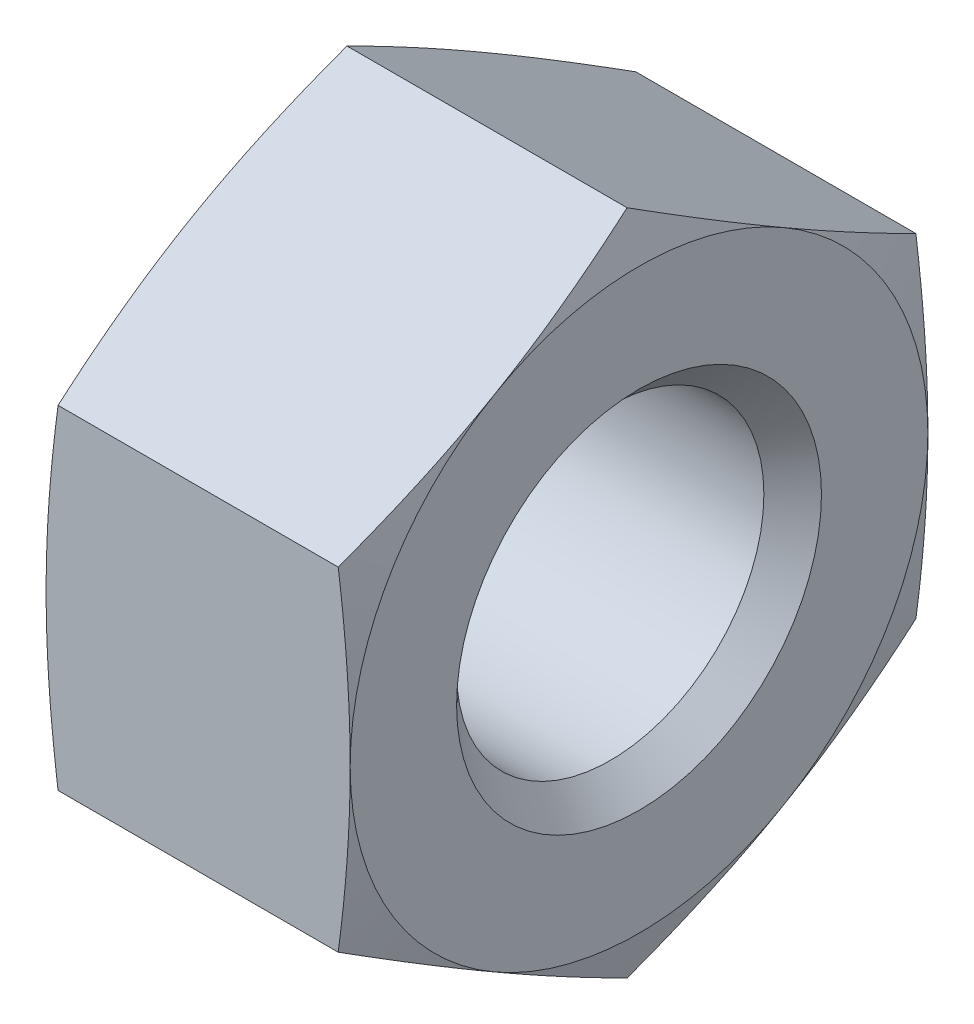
ISO-10303-21;
HEADER;
FILE_DESCRIPTION(('STEP AP214'),'2;1');
FILE_NAME('part.step','',(''),(''),'','','');
FILE_SCHEMA(('AUTOMOTIVE_DESIGN { 1 0 10303 214 1 1 1 1 }'));
ENDSEC;
DATA;
#1=APPLICATION_CONTEXT('core data for automotive mechanical design processes');
#2=APPLICATION_PROTOCOL_DEFINITION('international standard','automotive_design',2000,#1);
#3=PRODUCT_CONTEXT('',#1,'mechanical');
#4=PRODUCT('Part','Part','',(#3));
#5=PRODUCT_RELATED_PRODUCT_CATEGORY('part','',(#4));
#6=PRODUCT_DEFINITION_FORMATION('','',#4);
#7=PRODUCT_DEFINITION_CONTEXT('part definition',#1,'design');
#8=PRODUCT_DEFINITION('design','',#6,#7);
#9=PRODUCT_DEFINITION_SHAPE('','',#8);
#10=(LENGTH_UNIT() NAMED_UNIT(*) SI_UNIT(.MILLI.,.METRE.));
#11=(NAMED_UNIT(*) PLANE_ANGLE_UNIT() SI_UNIT($,.RADIAN.));
#12=(NAMED_UNIT(*) SI_UNIT($,.STERADIAN.) SOLID_ANGLE_UNIT());
#13=UNCERTAINTY_MEASURE_WITH_UNIT(LENGTH_MEASURE(1.E-05),#10,'distance_accuracy_value','');
#14=(GEOMETRIC_REPRESENTATION_CONTEXT(3) GLOBAL_UNCERTAINTY_ASSIGNED_CONTEXT((#13)) GLOBAL_UNIT_ASSIGNED_CONTEXT((#10,
#11,#12)) REPRESENTATION_CONTEXT('',''));
#15=CARTESIAN_POINT('',(0.,0.,0.));
#16=DIRECTION('',(0.,0.,1.));
#17=DIRECTION('',(1.,0.,0.));
#18=AXIS2_PLACEMENT_3D('',#15,#16,#17);
#19=CARTESIAN_POINT('',(10.,5.48482755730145,9.5));
#20=DIRECTION('',(0.,0.,-1.));
#21=DIRECTION('',(0.,-1.,0.));
#22=AXIS2_PLACEMENT_3D('',#19,#20,#21);
#23=PLANE('',#22);
#24=DIRECTION('',(-1.,0.,0.));
#25=VECTOR('',#24,1.);
#26=CARTESIAN_POINT('',(10.,-5.48482755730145,9.5));
#27=LINE('',#26,#25);
#28=CARTESIAN_POINT('',(9.60620709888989,-5.48482755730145,9.5));
#29=VERTEX_POINT('',#28);
#30=CARTESIAN_POINT('',(0.393792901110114,-5.48482755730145,9.5));
#31=VERTEX_POINT('',#30);
#32=EDGE_CURVE('E375',#29,#31,#27,.T.);
#33=ORIENTED_EDGE('',*,*,#32,.F.);
#34=CARTESIAN_POINT('',(9.99999999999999,0.,9.5));
#35=CARTESIAN_POINT('',(10.0000068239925,-0.152136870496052,9.49998439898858));
#36=CARTESIAN_POINT('',(9.99902837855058,-0.304273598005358,9.49997190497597));
#37=CARTESIAN_POINT('',(9.99511872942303,-0.608416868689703,9.49996278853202));
#38=CARTESIAN_POINT('',(9.99218887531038,-0.760423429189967,9.49996615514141));
#39=CARTESIAN_POINT('',(9.98437853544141,-1.06499575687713,9.49999843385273));
#40=CARTESIAN_POINT('',(9.97949028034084,-1.21756132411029,9.50002744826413));
#41=CARTESIAN_POINT('',(9.96784328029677,-1.52205132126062,9.50003049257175));
#42=CARTESIAN_POINT('',(9.96109157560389,-1.67397602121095,9.50000472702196));
#43=CARTESIAN_POINT('',(9.94571906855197,-1.9781034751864,9.49997404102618));
#44=CARTESIAN_POINT('',(9.93709373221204,-2.13030599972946,9.49996917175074));
#45=CARTESIAN_POINT('',(9.91798075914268,-2.4355781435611,9.49998552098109));
#46=CARTESIAN_POINT('',(9.9074814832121,-2.58864703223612,9.50000690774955));
#47=CARTESIAN_POINT('',(9.88499861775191,-2.89130356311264,9.49999324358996));
#48=CARTESIAN_POINT('',(9.87305258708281,-3.04089400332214,9.49995941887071));
#49=CARTESIAN_POINT('',(9.84749925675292,-3.34067954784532,9.49988136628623));
#50=CARTESIAN_POINT('',(9.83388401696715,-3.49087397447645,9.49983708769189));
#51=CARTESIAN_POINT('',(9.8049951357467,-3.79228027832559,9.49977947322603));
#52=CARTESIAN_POINT('',(9.78970943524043,-3.94349099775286,9.49976638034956));
#53=CARTESIAN_POINT('',(9.75748399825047,-4.24731309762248,9.49977500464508));
#54=CARTESIAN_POINT('',(9.74052882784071,-4.39992283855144,9.49979708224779));
#55=CARTESIAN_POINT('',(9.70496750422,-4.70689514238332,9.49986072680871));
#56=CARTESIAN_POINT('',(9.68634326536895,-4.8612556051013,9.49990253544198));
#57=CARTESIAN_POINT('',(9.64744611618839,-5.1720510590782,9.49997163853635));
#58=CARTESIAN_POINT('',(9.62715315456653,-5.32848354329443,9.49999871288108));
#59=CARTESIAN_POINT('',(9.60620709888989,-5.48482755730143,9.50000000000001));
#60=B_SPLINE_CURVE_WITH_KNOTS('',3,(#34,#35,#36,#37,#38,#39,#40,#41,#42,#43,#44,#45,#46,#47,#48,
#49,#50,#51,#52,#53,#54,#55,#56,#57,#58,#59),.UNSPECIFIED.,.F.,.F.,(4,2,2,2,2,2,2,2,2,2,2,2,4),
(0.,0.456407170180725,0.912499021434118,1.37041848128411,1.82663102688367,2.28396010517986,
2.74423535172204,3.19442658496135,3.64684905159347,4.10278536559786,4.56342429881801,
5.02985789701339,5.50308059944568),.UNSPECIFIED.);
#61=CARTESIAN_POINT('',(10.,0.,9.5));
#62=VERTEX_POINT('',#61);
#63=EDGE_CURVE('E41',#62,#29,#60,.T.);
#64=ORIENTED_EDGE('',*,*,#63,.F.);
#65=CARTESIAN_POINT('',(9.60620709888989,5.48482755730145,9.5));
#66=CARTESIAN_POINT('',(9.62712557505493,5.32868940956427,9.49999871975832));
#67=CARTESIAN_POINT('',(9.64739258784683,5.17246301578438,9.49997208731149));
#68=CARTESIAN_POINT('',(9.68624258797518,4.86207197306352,9.49990422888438));
#69=CARTESIAN_POINT('',(9.70484552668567,4.70790981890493,9.49986321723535));
#70=CARTESIAN_POINT('',(9.74036898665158,4.40132778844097,9.49980104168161));
#71=CARTESIAN_POINT('',(9.75730750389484,4.24891000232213,9.49977963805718));
#72=CARTESIAN_POINT('',(9.78950437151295,3.94546706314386,9.49977182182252));
#73=CARTESIAN_POINT('',(9.8047780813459,3.79444354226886,9.49978505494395));
#74=CARTESIAN_POINT('',(9.83364765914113,3.49340864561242,9.49984235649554));
#75=CARTESIAN_POINT('',(9.8472555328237,3.34339842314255,9.49988618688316));
#76=CARTESIAN_POINT('',(9.87279894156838,3.04398023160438,9.49996212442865));
#77=CARTESIAN_POINT('',(9.88474238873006,2.89457293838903,9.49999428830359));
#78=CARTESIAN_POINT('',(9.90723938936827,2.59208502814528,9.50000584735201));
#79=CARTESIAN_POINT('',(9.91775319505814,2.43900144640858,9.49998397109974));
#80=CARTESIAN_POINT('',(9.93689561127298,2.13368695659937,9.49996834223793));
#81=CARTESIAN_POINT('',(9.94553571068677,1.98145677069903,9.49997441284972));
#82=CARTESIAN_POINT('',(9.96093851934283,1.67726147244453,9.50000566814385));
#83=CARTESIAN_POINT('',(9.9677056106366,1.52529658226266,9.50003080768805));
#84=CARTESIAN_POINT('',(9.97939472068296,1.22041629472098,9.50002602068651));
#85=CARTESIAN_POINT('',(9.9843058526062,1.06750047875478,9.49999577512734));
#86=CARTESIAN_POINT('',(9.99215266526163,0.762223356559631,9.49996302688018));
#87=CARTESIAN_POINT('',(9.99509608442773,0.609862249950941,9.49996041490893));
#88=CARTESIAN_POINT('',(9.99902390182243,0.305000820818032,9.49997112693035));
#89=CARTESIAN_POINT('',(10.0000068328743,0.15250047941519,9.49998446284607));
#90=CARTESIAN_POINT('',(9.99999999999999,0.,9.5));
#91=B_SPLINE_CURVE_WITH_KNOTS('',3,(#65,#66,#67,#68,#69,#70,#71,#72,#73,#74,#75,#76,#77,#78,#79,
#80,#81,#82,#83,#84,#85,#86,#87,#88,#89,#90),.UNSPECIFIED.,.F.,.F.,(4,2,2,2,2,2,2,2,2,2,2,2,4),
(0.,0.472599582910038,0.938434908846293,1.39849601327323,1.85386999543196,2.30574014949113,
2.75538311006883,3.21570531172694,3.67311974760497,4.1294548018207,4.58842657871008,
5.04558256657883,5.50308054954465),.UNSPECIFIED.);
#92=CARTESIAN_POINT('',(9.60620709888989,5.48482755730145,9.5));
#93=VERTEX_POINT('',#92);
#94=EDGE_CURVE('E149',#93,#62,#91,.T.);
#95=ORIENTED_EDGE('',*,*,#94,.F.);
#96=DIRECTION('',(-1.,0.,0.));
#97=VECTOR('',#96,1.);
#98=CARTESIAN_POINT('',(10.,5.48482755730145,9.5));
#99=LINE('',#98,#97);
#100=CARTESIAN_POINT('',(0.393792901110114,5.48482755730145,9.5));
#101=VERTEX_POINT('',#100);
#102=EDGE_CURVE('E9',#93,#101,#99,.T.);
#103=ORIENTED_EDGE('',*,*,#102,.T.);
#104=CARTESIAN_POINT('',(0.,0.,9.5));
#105=CARTESIAN_POINT('',(-6.88921626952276E-06,0.152493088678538,9.49998424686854));
#106=CARTESIAN_POINT('',(0.000976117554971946,0.304986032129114,9.49997155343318));
#107=CARTESIAN_POINT('',(0.0049039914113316,0.609840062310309,9.4999621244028));
#108=CARTESIAN_POINT('',(0.00784748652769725,0.762201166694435,9.49996537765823));
#109=CARTESIAN_POINT('',(0.015694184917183,1.06748568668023,9.49999769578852));
#110=CARTESIAN_POINT('',(0.020605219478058,1.22040890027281,9.50002686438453));
#111=CARTESIAN_POINT('',(0.0322936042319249,1.52528190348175,9.50002996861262));
#112=CARTESIAN_POINT('',(0.0390597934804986,1.67723212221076,9.50000422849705));
#113=CARTESIAN_POINT('',(0.0544616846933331,1.98141260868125,9.49997369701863));
#114=CARTESIAN_POINT('',(0.0631019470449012,2.13364264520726,9.49996895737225));
#115=CARTESIAN_POINT('',(0.0822451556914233,2.43897181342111,9.49998544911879));
#116=CARTESIAN_POINT('',(0.092759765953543,2.59207021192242,9.50000684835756));
#117=CARTESIAN_POINT('',(0.115257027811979,2.89456847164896,9.4999933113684));
#118=CARTESIAN_POINT('',(0.127199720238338,3.04397131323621,9.49995967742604));
#119=CARTESIAN_POINT('',(0.152742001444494,3.3433822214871,9.49988210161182));
#120=CARTESIAN_POINT('',(0.166349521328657,3.49338961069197,9.49983810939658));
#121=CARTESIAN_POINT('',(0.195218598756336,3.79442059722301,9.49978086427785));
#122=CARTESIAN_POINT('',(0.210492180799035,3.94544303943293,9.49976785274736));
#123=CARTESIAN_POINT('',(0.242689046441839,4.24888568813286,9.49977642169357));
#124=CARTESIAN_POINT('',(0.259627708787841,4.40130426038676,9.4997983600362));
#125=CARTESIAN_POINT('',(0.295151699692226,4.70788983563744,9.49986160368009));
#126=CARTESIAN_POINT('',(0.313755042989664,4.86205474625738,9.49990314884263));
#127=CARTESIAN_POINT('',(0.352606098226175,5.17245336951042,9.4999718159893));
#128=CARTESIAN_POINT('',(0.372873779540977,5.32868458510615,9.49999871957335));
#129=CARTESIAN_POINT('',(0.393792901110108,5.48482755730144,9.5));
#130=B_SPLINE_CURVE_WITH_KNOTS('',3,(#104,#105,#106,#107,#108,#109,#110,#111,#112,#113,#114,
#115,#116,#117,#118,#119,#120,#121,#122,#123,#124,#125,#126,#127,#128,#129),.UNSPECIFIED.,.F.,
.F.,(4,2,2,2,2,2,2,2,2,2,2,2,4),(0.,0.457475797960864,0.914631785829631,1.37362573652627,
1.82991669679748,2.28733071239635,2.74769742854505,3.19732689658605,3.64918848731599,
4.10455921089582,4.56462270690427,5.03046638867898,5.50308057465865),.UNSPECIFIED.);
#131=CARTESIAN_POINT('',(0.,0.,9.5));
#132=VERTEX_POINT('',#131);
#133=EDGE_CURVE('E359',#132,#101,#130,.T.);
#134=ORIENTED_EDGE('',*,*,#133,.F.);
#135=CARTESIAN_POINT('',(0.39379290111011,-5.48482755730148,9.49999999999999));
#136=CARTESIAN_POINT('',(0.37284749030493,-5.32848836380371,9.49999871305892));
#137=CARTESIAN_POINT('',(0.352555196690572,-5.17206069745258,9.49997190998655));
#138=CARTESIAN_POINT('',(0.313659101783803,-4.86127281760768,9.49990361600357));
#139=CARTESIAN_POINT('',(0.29503526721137,-4.7069151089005,9.49986234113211));
#140=CARTESIAN_POINT('',(0.259474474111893,-4.39994634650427,9.49979976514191));
#141=CARTESIAN_POINT('',(0.242519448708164,-4.24733739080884,9.49977822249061));
#142=CARTESIAN_POINT('',(0.210294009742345,-3.94351500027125,9.49977035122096));
#143=CARTESIAN_POINT('',(0.195008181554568,-3.79230320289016,9.49978366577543));
#144=CARTESIAN_POINT('',(0.166118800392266,-3.49089299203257,9.49984133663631));
#145=CARTESIAN_POINT('',(0.152503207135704,-3.34069573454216,9.49988545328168));
#146=CARTESIAN_POINT('',(0.126948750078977,-3.04090291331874,9.49996186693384));
#147=CARTESIAN_POINT('',(0.115001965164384,-2.89130802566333,9.49999422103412));
#148=CARTESIAN_POINT('',(0.0925193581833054,-2.58866181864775,9.50000590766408));
#149=CARTESIAN_POINT('',(0.0820208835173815,-2.43560771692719,9.49998404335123));
#150=CARTESIAN_POINT('',(0.0629086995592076,-2.13035022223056,9.49996855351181));
#151=CARTESIAN_POINT('',(0.0542835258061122,-1.97814754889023,9.49997475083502));
#152=CARTESIAN_POINT('',(0.0389101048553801,-1.67400531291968,9.50000616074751));
#153=CARTESIAN_POINT('',(0.032157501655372,-1.52206597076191,9.50003132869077));
#154=CARTESIAN_POINT('',(0.0205097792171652,-1.21756869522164,9.50002660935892));
#155=CARTESIAN_POINT('',(0.0156214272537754,-1.06501050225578,9.49999652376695));
#156=CARTESIAN_POINT('',(0.00781097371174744,-0.760445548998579,9.49996381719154));
#157=CARTESIAN_POINT('',(0.00488119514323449,-0.6084389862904,9.49996108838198));
#158=CARTESIAN_POINT('',(0.000971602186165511,-0.304288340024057,9.49997148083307));
#159=CARTESIAN_POINT('',(-6.76794188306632E-06,-0.152144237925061,9.49998461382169));
#160=CARTESIAN_POINT('',(0.,0.,9.5));
#161=B_SPLINE_CURVE_WITH_KNOTS('',3,(#135,#136,#137,#138,#139,#140,#141,#142,#143,#144,#145,
#146,#147,#148,#149,#150,#151,#152,#153,#154,#155,#156,#157,#158,#159,#160),.UNSPECIFIED.,.F.,
.F.,(4,2,2,2,2,2,2,2,2,2,2,2,4),(0.,0.473208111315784,0.939633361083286,1.40026990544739,
1.85620947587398,2.30864049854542,2.75884521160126,3.21907603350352,3.67640553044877,
4.13266208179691,4.59055943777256,5.04665128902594,5.50308057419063),.UNSPECIFIED.);
#162=EDGE_CURVE('E336',#31,#132,#161,.T.);
#163=ORIENTED_EDGE('',*,*,#162,.F.);
#164=EDGE_LOOP('',(#33,#64,#95,#103,#134,#163));
#165=FACE_BOUND('',#164,.T.);
#166=ADVANCED_FACE('F14',(#165),#23,.F.);
#167=CARTESIAN_POINT('',(10.,10.9696551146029,0.));
#168=DIRECTION('',(0.,-0.866025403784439,-0.5));
#169=DIRECTION('',(0.,0.5,-0.866025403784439));
#170=AXIS2_PLACEMENT_3D('',#167,#168,#169);
#171=PLANE('',#170);
#172=ORIENTED_EDGE('',*,*,#102,.F.);
#173=CARTESIAN_POINT('',(9.99999999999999,8.22724133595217,4.75));
#174=CARTESIAN_POINT('',(10.0000068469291,8.15109702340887,4.88185450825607));
#175=CARTESIAN_POINT('',(9.99902680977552,8.07495545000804,5.01371043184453));
#176=CARTESIAN_POINT('',(9.99511079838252,7.92275150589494,5.27731688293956));
#177=CARTESIAN_POINT('',(9.99217618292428,7.84668911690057,5.40906742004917));
#178=CARTESIAN_POINT('',(9.98435315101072,7.69430645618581,5.67306644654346));
#179=CARTESIAN_POINT('',(9.97945694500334,7.61798637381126,5.80531481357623));
#180=CARTESIAN_POINT('',(9.9677973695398,7.46570171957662,6.06908570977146));
#181=CARTESIAN_POINT('',(9.96104308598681,7.38973720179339,6.20060867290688));
#182=CARTESIAN_POINT('',(9.94566646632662,7.23768690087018,6.46390636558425));
#183=CARTESIAN_POINT('',(9.93703959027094,7.16160127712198,6.59568092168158));
#184=CARTESIAN_POINT('',(9.91792458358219,7.0090189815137,6.85999402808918));
#185=CARTESIAN_POINT('',(9.90742481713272,6.93252282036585,6.99253202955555));
#186=CARTESIAN_POINT('',(9.88494218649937,6.78122323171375,7.2545633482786));
#187=CARTESIAN_POINT('',(9.87299689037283,6.70641946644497,7.38405970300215));
#188=CARTESIAN_POINT('',(9.84744599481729,6.55650055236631,7.64357098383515));
#189=CARTESIAN_POINT('',(9.83383245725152,6.4813856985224,7.77358529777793));
#190=CARTESIAN_POINT('',(9.80494794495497,6.33067416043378,8.03451027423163));
#191=CARTESIAN_POINT('',(9.78966491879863,6.25507826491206,8.16542005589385));
#192=CARTESIAN_POINT('',(9.7574457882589,6.10321656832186,8.42846945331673));
#193=CARTESIAN_POINT('',(9.74049426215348,6.02695189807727,8.56060783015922));
#194=CARTESIAN_POINT('',(9.70494118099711,5.87356348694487,8.82641146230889));
#195=CARTESIAN_POINT('',(9.68632155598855,5.79644100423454,8.96007502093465));
#196=CARTESIAN_POINT('',(9.64743458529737,5.64114685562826,9.22919038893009));
#197=CARTESIAN_POINT('',(9.62714720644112,5.56297625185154,9.36463991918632));
#198=CARTESIAN_POINT('',(9.60620709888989,5.48482755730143,9.49999999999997));
#199=B_SPLINE_CURVE_WITH_KNOTS('',3,(#173,#174,#175,#176,#177,#178,#179,#180,#181,#182,#183,
#184,#185,#186,#187,#188,#189,#190,#191,#192,#193,#194,#195,#196,#197,#198),.UNSPECIFIED.,.F.,
.F.,(4,2,2,2,2,2,2,2,2,2,2,2,4),(0.,0.456781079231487,0.913244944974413,1.37153970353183,
1.82763208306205,2.28484282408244,2.74499986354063,3.19506705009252,3.64736566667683,
4.10317708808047,4.56368895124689,5.02999227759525,5.50308059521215),.UNSPECIFIED.);
#200=CARTESIAN_POINT('',(10.,8.22724133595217,4.75));
#201=VERTEX_POINT('',#200);
#202=EDGE_CURVE('E160',#201,#93,#199,.T.);
#203=ORIENTED_EDGE('',*,*,#202,.F.);
#204=CARTESIAN_POINT('',(9.60620709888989,10.9696551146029,0.));
#205=CARTESIAN_POINT('',(9.62714656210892,10.8915066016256,0.135354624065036));
#206=CARTESIAN_POINT('',(9.64743327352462,10.8132918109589,0.270773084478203));
#207=CARTESIAN_POINT('',(9.68631919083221,10.6578826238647,0.539813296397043));
#208=CARTESIAN_POINT('',(9.7049384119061,10.5806896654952,0.673432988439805));
#209=CARTESIAN_POINT('',(9.74049096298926,10.4271938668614,0.939170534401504));
#210=CARTESIAN_POINT('',(9.75744234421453,10.3508918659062,1.07128645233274));
#211=CARTESIAN_POINT('',(9.78966147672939,10.1990157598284,1.33432786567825));
#212=CARTESIAN_POINT('',(9.80494463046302,10.12344216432,1.46525176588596));
#213=CARTESIAN_POINT('',(9.83382964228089,9.97282837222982,1.72623768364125));
#214=CARTESIAN_POINT('',(9.84744353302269,9.89778854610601,1.85629858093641));
#215=CARTESIAN_POINT('',(9.87299555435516,9.74799958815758,2.11589328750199));
#216=CARTESIAN_POINT('',(9.88494160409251,9.67325084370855,2.24542653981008));
#217=CARTESIAN_POINT('',(9.90742397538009,9.52197831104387,2.50746155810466));
#218=CARTESIAN_POINT('',(9.91792294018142,9.44545209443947,2.63996513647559));
#219=CARTESIAN_POINT('',(9.93703715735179,9.29284944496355,2.90424958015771));
#220=CARTESIAN_POINT('',(9.94566387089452,9.21677321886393,3.0360297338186));
#221=CARTESIAN_POINT('',(9.96104140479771,9.06476911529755,3.29937116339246));
#222=CARTESIAN_POINT('',(9.96779658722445,8.98884130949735,3.43093222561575));
#223=CARTESIAN_POINT('',(9.97945688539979,8.83654625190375,3.69470551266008));
#224=CARTESIAN_POINT('',(9.98435318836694,8.7601786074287,3.82691790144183));
#225=CARTESIAN_POINT('',(9.9921763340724,8.60774339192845,4.09087806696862));
#226=CARTESIAN_POINT('',(9.9951108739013,8.53167582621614,4.22262561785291));
#227=CARTESIAN_POINT('',(9.99902682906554,8.37948533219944,4.48624835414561));
#228=CARTESIAN_POINT('',(10.0000067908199,8.30336240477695,4.61812356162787));
#229=CARTESIAN_POINT('',(9.99999999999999,8.22724133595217,4.75));
#230=B_SPLINE_CURVE_WITH_KNOTS('',3,(#204,#205,#206,#207,#208,#209,#210,#211,#212,#213,#214,
#215,#216,#217,#218,#219,#220,#221,#222,#223,#224,#225,#226,#227,#228,#229),.UNSPECIFIED.,.F.,
.F.,(4,2,2,2,2,2,2,2,2,2,2,2,4),(0.,0.473073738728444,0.939368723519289,1.39987819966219,
1.85569287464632,2.30800004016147,2.75808069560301,3.21819332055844,3.67540448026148,
4.13154085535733,4.58981350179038,5.0462773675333,5.50308057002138),.UNSPECIFIED.);
#231=CARTESIAN_POINT('',(9.60620709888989,10.9696551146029,0.));
#232=VERTEX_POINT('',#231);
#233=EDGE_CURVE('E176',#232,#201,#230,.T.);
#234=ORIENTED_EDGE('',*,*,#233,.F.);
#235=DIRECTION('',(-1.,0.,0.));
#236=VECTOR('',#235,1.);
#237=CARTESIAN_POINT('',(10.,10.9696551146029,0.));
#238=LINE('',#237,#236);
#239=CARTESIAN_POINT('',(0.393792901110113,10.9696551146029,0.));
#240=VERTEX_POINT('',#239);
#241=EDGE_CURVE('E27',#232,#240,#238,.T.);
#242=ORIENTED_EDGE('',*,*,#241,.T.);
#243=CARTESIAN_POINT('',(0.,8.22724133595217,4.75));
#244=CARTESIAN_POINT('',(-6.84692919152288E-06,8.30335853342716,4.61812983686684));
#245=CARTESIAN_POINT('',(0.000973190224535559,8.37947832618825,4.48626133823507));
#246=CARTESIAN_POINT('',(0.00488920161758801,8.53166623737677,4.22264563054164));
#247=CARTESIAN_POINT('',(0.00782381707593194,8.60773435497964,4.0908984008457));
#248=CARTESIAN_POINT('',(0.015646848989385,8.7601728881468,3.82693163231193));
#249=CARTESIAN_POINT('',(0.0205430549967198,8.83654329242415,3.69471231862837));
#250=CARTESIAN_POINT('',(0.0322026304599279,8.98883326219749,3.43094449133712));
#251=CARTESIAN_POINT('',(0.038956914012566,9.06475323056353,3.29939580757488));
#252=CARTESIAN_POINT('',(0.0543335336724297,9.21675057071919,3.03606753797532));
#253=CARTESIAN_POINT('',(0.0629604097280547,9.29282787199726,2.90428817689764));
#254=CARTESIAN_POINT('',(0.0820754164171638,9.44543858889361,2.63999147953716));
#255=CARTESIAN_POINT('',(0.0925751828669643,9.52197178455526,2.50747485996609));
#256=CARTESIAN_POINT('',(0.115057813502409,9.67324776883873,2.24542991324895));
#257=CARTESIAN_POINT('',(0.127003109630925,9.74799301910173,2.11589977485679));
#258=CARTESIAN_POINT('',(0.1525540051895,9.89777692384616,1.85631054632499));
#259=CARTESIAN_POINT('',(0.166167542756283,9.97281519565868,1.72625201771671));
#260=CARTESIAN_POINT('',(0.195052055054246,10.1234270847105,1.46526950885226));
#261=CARTESIAN_POINT('',(0.210335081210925,10.1990003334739,1.33434665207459));
#262=CARTESIAN_POINT('',(0.242554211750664,10.3508769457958,1.07130586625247));
#263=CARTESIAN_POINT('',(0.259505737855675,10.4271798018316,0.939189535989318));
#264=CARTESIAN_POINT('',(0.295058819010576,10.5806782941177,0.673449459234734));
#265=CARTESIAN_POINT('',(0.313678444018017,10.6578730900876,0.539827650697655));
#266=CARTESIAN_POINT('',(0.352565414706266,10.8132867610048,0.270781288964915));
#267=CARTESIAN_POINT('',(0.372852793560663,10.8915041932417,0.135358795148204));
#268=CARTESIAN_POINT('',(0.393792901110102,10.9696551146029,0.));
#269=B_SPLINE_CURVE_WITH_KNOTS('',3,(#243,#244,#245,#246,#247,#248,#249,#250,#251,#252,#253,
#254,#255,#256,#257,#258,#259,#260,#261,#262,#263,#264,#265,#266,#267,#268),.UNSPECIFIED.,.F.,
.F.,(4,2,2,2,2,2,2,2,2,2,2,2,4),(0.,0.456781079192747,0.913244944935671,1.3715397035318,
1.82763208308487,2.28484282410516,2.74499986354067,3.19506705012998,3.64736566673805,
4.10317708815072,4.56368895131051,5.0299922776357,5.50308059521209),.UNSPECIFIED.);
#270=CARTESIAN_POINT('',(0.,8.22724133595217,4.75));
#271=VERTEX_POINT('',#270);
#272=EDGE_CURVE('E547',#271,#240,#269,.T.);
#273=ORIENTED_EDGE('',*,*,#272,.F.);
#274=CARTESIAN_POINT('',(0.3937929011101,5.48482755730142,9.49999999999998));
#275=CARTESIAN_POINT('',(0.37285343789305,5.56297384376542,9.36464409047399));
#276=CARTESIAN_POINT('',(0.352566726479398,5.64114227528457,9.22919886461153));
#277=CARTESIAN_POINT('',(0.313680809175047,5.79643333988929,8.96009045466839));
#278=CARTESIAN_POINT('',(0.295061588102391,5.87355490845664,8.82642954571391));
#279=CARTESIAN_POINT('',(0.259509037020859,6.02694247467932,8.56062951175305));
#280=CARTESIAN_POINT('',(0.24255765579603,6.1032072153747,8.42849208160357));
#281=CARTESIAN_POINT('',(0.210338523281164,6.25506970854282,8.16544280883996));
#282=CARTESIAN_POINT('',(0.195055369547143,6.33066633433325,8.03453220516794));
#283=CARTESIAN_POINT('',(0.166170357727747,6.48137987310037,7.77360387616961));
#284=CARTESIAN_POINT('',(0.152556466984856,6.55649600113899,7.64358703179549));
#285=CARTESIAN_POINT('',(0.127004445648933,6.70641713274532,7.38406863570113));
#286=CARTESIAN_POINT('',(0.115058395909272,6.78122184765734,7.25456769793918));
#287=CARTESIAN_POINT('',(0.092576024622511,6.93251456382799,6.9925443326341));
#288=CARTESIAN_POINT('',(0.0820770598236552,7.0090029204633,6.86001889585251));
#289=CARTESIAN_POINT('',(0.0629628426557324,7.16157863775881,6.59571890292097));
#290=CARTESIAN_POINT('',(0.0543361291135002,7.23766548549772,6.46394488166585));
#291=CARTESIAN_POINT('',(0.0389585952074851,7.38972380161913,6.20063475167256));
#292=CARTESIAN_POINT('',(0.0322034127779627,7.46569512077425,6.06909881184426));
#293=CARTESIAN_POINT('',(0.0205431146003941,7.61798195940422,5.80532077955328));
#294=CARTESIAN_POINT('',(0.0156468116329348,7.6942974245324,5.67307826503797));
#295=CARTESIAN_POINT('',(0.00782366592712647,7.84667602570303,5.40908541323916));
#296=CARTESIAN_POINT('',(0.00488912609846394,7.92273896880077,5.27733519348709));
#297=CARTESIAN_POINT('',(0.000973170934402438,8.07494770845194,5.01372299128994));
#298=CARTESIAN_POINT('',(-6.79081973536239E-06,8.15109352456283,4.88186099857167));
#299=CARTESIAN_POINT('',(0.,8.22724133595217,4.75));
#300=B_SPLINE_CURVE_WITH_KNOTS('',3,(#274,#275,#276,#277,#278,#279,#280,#281,#282,#283,#284,
#285,#286,#287,#288,#289,#290,#291,#292,#293,#294,#295,#296,#297,#298,#299),.UNSPECIFIED.,.F.,
.F.,(4,2,2,2,2,2,2,2,2,2,2,2,4),(0.,0.473073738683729,0.939368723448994,1.39987819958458,
1.85569287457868,2.30800004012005,2.7580806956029,3.21819332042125,3.67540448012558,
4.13154085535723,4.58981350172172,5.04627736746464,5.50308057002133),.UNSPECIFIED.);
#301=EDGE_CURVE('E170',#101,#271,#300,.T.);
#302=ORIENTED_EDGE('',*,*,#301,.F.);
#303=EDGE_LOOP('',(#172,#203,#234,#242,#273,#302));
#304=FACE_BOUND('',#303,.T.);
#305=ADVANCED_FACE('F166',(#304),#171,.F.);
#306=CARTESIAN_POINT('',(10.,-5.48482755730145,9.5));
#307=DIRECTION('',(0.,0.866025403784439,-0.5));
#308=DIRECTION('',(-1.,0.,0.));
#309=AXIS2_PLACEMENT_3D('',#306,#307,#308);
#310=PLANE('',#309);
#311=DIRECTION('',(-1.,0.,0.));
#312=VECTOR('',#311,1.);
#313=CARTESIAN_POINT('',(10.,-10.9696551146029,0.));
#314=LINE('',#313,#312);
#315=CARTESIAN_POINT('',(9.60620709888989,-10.9696551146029,0.));
#316=VERTEX_POINT('',#315);
#317=CARTESIAN_POINT('',(0.393792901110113,-10.9696551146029,0.));
#318=VERTEX_POINT('',#317);
#319=EDGE_CURVE('E267',#316,#318,#314,.T.);
#320=ORIENTED_EDGE('',*,*,#319,.F.);
#321=CARTESIAN_POINT('',(9.99999999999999,-8.22724133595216,4.75000000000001));
#322=CARTESIAN_POINT('',(10.0000068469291,-8.30335853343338,4.6181298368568));
#323=CARTESIAN_POINT('',(9.99902680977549,-8.37947832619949,4.48626133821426));
#324=CARTESIAN_POINT('',(9.99511079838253,-8.53166623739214,4.22264563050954));
#325=CARTESIAN_POINT('',(9.99217618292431,-8.60773435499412,4.09089840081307));
#326=CARTESIAN_POINT('',(9.98435315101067,-8.760172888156,3.8269316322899));
#327=CARTESIAN_POINT('',(9.97945694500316,-8.83654329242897,3.69471231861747));
#328=CARTESIAN_POINT('',(9.96779736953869,-8.98883326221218,3.43094449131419));
#329=CARTESIAN_POINT('',(9.96104308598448,-9.06475323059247,3.2993958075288));
#330=CARTESIAN_POINT('',(9.945666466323,-9.21675057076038,3.03606753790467));
#331=CARTESIAN_POINT('',(9.93703959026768,-9.29282787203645,2.90428817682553));
#332=CARTESIAN_POINT('',(9.91792458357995,-9.44543858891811,2.63999147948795));
#333=CARTESIAN_POINT('',(9.90742481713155,-9.52197178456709,2.50747485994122));
#334=CARTESIAN_POINT('',(9.88494218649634,-9.67324776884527,2.24542991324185));
#335=CARTESIAN_POINT('',(9.87299689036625,-9.74799301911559,2.11589977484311));
#336=CARTESIAN_POINT('',(9.84744599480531,-9.89777692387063,1.85631054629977));
#337=CARTESIAN_POINT('',(9.83383245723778,-9.97281519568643,1.7262520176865));
#338=CARTESIAN_POINT('',(9.80494794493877,-10.1234270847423,1.46526950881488));
#339=CARTESIAN_POINT('',(9.78966491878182,-10.1990003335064,1.33434665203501));
#340=CARTESIAN_POINT('',(9.75744578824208,-10.3508769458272,1.07130586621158));
#341=CARTESIAN_POINT('',(9.74049426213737,-10.4271798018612,0.939189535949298));
#342=CARTESIAN_POINT('',(9.70494118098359,-10.5806782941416,0.673449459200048));
#343=CARTESIAN_POINT('',(9.686321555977,-10.6578730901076,0.539827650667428));
#344=CARTESIAN_POINT('',(9.64743458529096,-10.8132867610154,0.270781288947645));
#345=CARTESIAN_POINT('',(9.62714720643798,-10.8915041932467,0.135358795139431));
#346=CARTESIAN_POINT('',(9.60620709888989,-10.9696551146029,0.));
#347=B_SPLINE_CURVE_WITH_KNOTS('',3,(#321,#322,#323,#324,#325,#326,#327,#328,#329,#330,#331,
#332,#333,#334,#335,#336,#337,#338,#339,#340,#341,#342,#343,#344,#345,#346),.UNSPECIFIED.,.F.,
.F.,(4,2,2,2,2,2,2,2,2,2,2,2,4),(0.,0.456781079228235,0.913244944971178,1.37153970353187,
1.82763208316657,2.2848428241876,2.74499986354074,3.1950670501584,3.64736566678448,
4.10317708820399,4.56368895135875,5.02999227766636,5.50308059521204),.UNSPECIFIED.);
#348=CARTESIAN_POINT('',(10.,-8.22724133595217,4.75));
#349=VERTEX_POINT('',#348);
#350=EDGE_CURVE('E318',#349,#316,#347,.T.);
#351=ORIENTED_EDGE('',*,*,#350,.F.);
#352=CARTESIAN_POINT('',(9.60620709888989,-5.48482755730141,9.49999999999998));
#353=CARTESIAN_POINT('',(9.62714656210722,-5.56297384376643,9.36464409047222));
#354=CARTESIAN_POINT('',(9.64743327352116,-5.64114227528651,9.22919886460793));
#355=CARTESIAN_POINT('',(9.68631919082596,-5.79643333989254,8.96009045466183));
#356=CARTESIAN_POINT('',(9.70493841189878,-5.87355490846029,8.82642954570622));
#357=CARTESIAN_POINT('',(9.74049096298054,-6.02694247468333,8.56062951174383));
#358=CARTESIAN_POINT('',(9.75744234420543,-6.10320721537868,8.42849208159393));
#359=CARTESIAN_POINT('',(9.78966147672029,-6.25506970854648,8.16544280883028));
#360=CARTESIAN_POINT('',(9.80494463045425,-6.33066633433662,8.03453220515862));
#361=CARTESIAN_POINT('',(9.83382964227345,-6.48137987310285,7.77360387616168));
#362=CARTESIAN_POINT('',(9.84744353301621,-6.55649600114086,7.6435870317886));
#363=CARTESIAN_POINT('',(9.8729955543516,-6.70641713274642,7.38406863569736));
#364=CARTESIAN_POINT('',(9.88494160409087,-6.78122184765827,7.25456769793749));
#365=CARTESIAN_POINT('',(9.90742397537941,-6.93251456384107,6.99254433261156));
#366=CARTESIAN_POINT('',(9.91792294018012,-7.00900292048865,6.86001889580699));
#367=CARTESIAN_POINT('',(9.93703715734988,-7.16157863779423,6.59571890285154));
#368=CARTESIAN_POINT('',(9.94566387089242,-7.23766548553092,6.46394488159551));
#369=CARTESIAN_POINT('',(9.96104140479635,-7.38972380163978,6.20063475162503));
#370=CARTESIAN_POINT('',(9.96779658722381,-7.46569512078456,6.06909881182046));
#371=CARTESIAN_POINT('',(9.97945688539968,-7.61798195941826,5.80532077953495));
#372=CARTESIAN_POINT('',(9.98435318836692,-7.69429742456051,5.67307826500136));
#373=CARTESIAN_POINT('',(9.99217633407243,-7.84667602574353,5.40908541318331));
#374=CARTESIAN_POINT('',(9.99511087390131,-7.92273896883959,5.27733519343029));
#375=CARTESIAN_POINT('',(9.99902682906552,-8.07494770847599,5.01372299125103));
#376=CARTESIAN_POINT('',(10.0000067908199,-8.15109352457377,4.88186099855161));
#377=CARTESIAN_POINT('',(9.99999999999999,-8.22724133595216,4.75000000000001));
#378=B_SPLINE_CURVE_WITH_KNOTS('',3,(#352,#353,#354,#355,#356,#357,#358,#359,#360,#361,#362,
#363,#364,#365,#366,#367,#368,#369,#370,#371,#372,#373,#374,#375,#376,#377),.UNSPECIFIED.,.F.,
.F.,(4,2,2,2,2,2,2,2,2,2,2,2,4),(0.,0.473073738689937,0.939368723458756,1.39987819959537,
1.8556928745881,2.30800004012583,2.75808069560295,3.21819332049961,3.67540448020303,
4.13154085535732,4.58981350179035,5.04627736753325,5.50308057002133),.UNSPECIFIED.);
#379=EDGE_CURVE('E320',#29,#349,#378,.T.);
#380=ORIENTED_EDGE('',*,*,#379,.F.);
#381=ORIENTED_EDGE('',*,*,#32,.T.);
#382=CARTESIAN_POINT('',(0.,-8.22724133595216,4.75000000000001));
#383=CARTESIAN_POINT('',(-6.84692922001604E-06,-8.15109702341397,4.88185450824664));
#384=CARTESIAN_POINT('',(0.000973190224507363,-8.07495545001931,5.01371043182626));
#385=CARTESIAN_POINT('',(0.0048892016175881,-7.92275150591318,5.2773168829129));
#386=CARTESIAN_POINT('',(0.00782381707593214,-7.84668911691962,5.40906742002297));
#387=CARTESIAN_POINT('',(0.0156468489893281,-7.69430645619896,5.67306644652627));
#388=CARTESIAN_POINT('',(0.0205430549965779,-7.61798637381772,5.80531481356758));
#389=CARTESIAN_POINT('',(0.0322026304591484,-7.46570171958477,6.06908570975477));
#390=CARTESIAN_POINT('',(0.038956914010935,-7.38973720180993,6.20060867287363));
#391=CARTESIAN_POINT('',(0.0543335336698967,-7.23768690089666,6.46390636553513));
#392=CARTESIAN_POINT('',(0.0629604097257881,-7.16160127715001,6.59568092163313));
#393=CARTESIAN_POINT('',(0.0820754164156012,-7.00901898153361,6.85999402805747));
#394=CARTESIAN_POINT('',(0.0925751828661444,-6.93252282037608,6.99253202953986));
#395=CARTESIAN_POINT('',(0.115057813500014,-6.78122323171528,7.25456334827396));
#396=CARTESIAN_POINT('',(0.127003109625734,-6.70641946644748,7.38405970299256));
#397=CARTESIAN_POINT('',(0.15255400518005,-6.55650055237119,7.64357098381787));
#398=CARTESIAN_POINT('',(0.166167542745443,-6.48138569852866,7.77358529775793));
#399=CARTESIAN_POINT('',(0.195052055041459,-6.33067416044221,8.03451027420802));
#400=CARTESIAN_POINT('',(0.210335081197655,-6.25507826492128,8.16542005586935));
#401=CARTESIAN_POINT('',(0.242554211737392,-6.10321656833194,8.42846945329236));
#402=CARTESIAN_POINT('',(0.25950573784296,-6.02695189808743,8.56060783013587));
#403=CARTESIAN_POINT('',(0.295058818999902,-5.87356348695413,8.82641146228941));
#404=CARTESIAN_POINT('',(0.313678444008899,-5.79644100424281,8.96007502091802));
#405=CARTESIAN_POINT('',(0.35256541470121,-5.64114685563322,9.22919038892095));
#406=CARTESIAN_POINT('',(0.372852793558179,-5.56297625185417,9.36463991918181));
#407=CARTESIAN_POINT('',(0.3937929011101,-5.48482755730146,9.49999999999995));
#408=B_SPLINE_CURVE_WITH_KNOTS('',3,(#382,#383,#384,#385,#386,#387,#388,#389,#390,#391,#392,
#393,#394,#395,#396,#397,#398,#399,#400,#401,#402,#403,#404,#405,#406,#407),.UNSPECIFIED.,.F.,
.F.,(4,2,2,2,2,2,2,2,2,2,2,2,4),(0.,0.45678107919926,0.913244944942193,1.37153970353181,
1.82763208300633,2.28484282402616,2.74499986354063,3.195067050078,3.64736566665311,
4.10317708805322,4.5636889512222,5.02999227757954,5.50308059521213),.UNSPECIFIED.);
#409=CARTESIAN_POINT('',(0.,-8.22724133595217,4.75));
#410=VERTEX_POINT('',#409);
#411=EDGE_CURVE('E330',#410,#31,#408,.T.);
#412=ORIENTED_EDGE('',*,*,#411,.F.);
#413=CARTESIAN_POINT('',(0.393792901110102,-10.9696551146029,0.));
#414=CARTESIAN_POINT('',(0.372853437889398,-10.8915066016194,0.135354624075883));
#415=CARTESIAN_POINT('',(0.352566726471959,-10.8132918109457,0.27077308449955));
#416=CARTESIAN_POINT('',(0.313680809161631,-10.6578826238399,0.539813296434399));
#417=CARTESIAN_POINT('',(0.295061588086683,-10.5806896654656,0.67343298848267));
#418=CARTESIAN_POINT('',(0.259509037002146,-10.4271938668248,0.939170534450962));
#419=CARTESIAN_POINT('',(0.242557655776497,-10.3508918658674,1.07128645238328));
#420=CARTESIAN_POINT('',(0.210338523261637,-10.1990157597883,1.33432786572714));
#421=CARTESIAN_POINT('',(0.195055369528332,-10.1234421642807,1.46525176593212));
#422=CARTESIAN_POINT('',(0.16617035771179,-9.97282837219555,1.72623768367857));
#423=CARTESIAN_POINT('',(0.152556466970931,-9.89778854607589,1.85629858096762));
#424=CARTESIAN_POINT('',(0.127004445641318,-9.74799958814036,2.11589328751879));
#425=CARTESIAN_POINT('',(0.115058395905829,-9.67325084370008,2.24542653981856));
#426=CARTESIAN_POINT('',(0.0925760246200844,-9.52197831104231,2.5074615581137));
#427=CARTESIAN_POINT('',(0.082077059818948,-9.44545209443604,2.63996513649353));
#428=CARTESIAN_POINT('',(0.0629628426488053,-9.29284944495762,2.90424958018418));
#429=CARTESIAN_POINT('',(0.0543361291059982,-9.21677321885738,3.03602973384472));
#430=CARTESIAN_POINT('',(0.0389585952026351,-9.06476911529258,3.29937116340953));
#431=CARTESIAN_POINT('',(0.0322034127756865,-8.98884130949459,3.43093222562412));
#432=CARTESIAN_POINT('',(0.0205431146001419,-8.83654625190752,3.69470551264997));
#433=CARTESIAN_POINT('',(0.015646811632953,-8.7601786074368,3.82691790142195));
#434=CARTESIAN_POINT('',(0.00782366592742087,-8.60774339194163,4.09087806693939));
#435=CARTESIAN_POINT('',(0.00488912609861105,-8.53167582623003,4.2226256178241));
#436=CARTESIAN_POINT('',(0.000973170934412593,-8.37948533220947,4.48624835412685));
#437=CARTESIAN_POINT('',(-6.79081987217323E-06,-8.30336240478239,4.61812356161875));
#438=CARTESIAN_POINT('',(0.,-8.22724133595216,4.75000000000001));
#439=B_SPLINE_CURVE_WITH_KNOTS('',3,(#413,#414,#415,#416,#417,#418,#419,#420,#421,#422,#423,
#424,#425,#426,#427,#428,#429,#430,#431,#432,#433,#434,#435,#436,#437,#438),.UNSPECIFIED.,.F.,
.F.,(4,2,2,2,2,2,2,2,2,2,2,2,4),(0.,0.473073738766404,0.939368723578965,1.39987819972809,
1.85569287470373,2.30800004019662,2.7580806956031,3.21819332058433,3.6754044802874,
4.13154085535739,4.58981350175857,5.04627736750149,5.50308057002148),.UNSPECIFIED.);
#440=EDGE_CURVE('E409',#318,#410,#439,.T.);
#441=ORIENTED_EDGE('',*,*,#440,.F.);
#442=EDGE_LOOP('',(#320,#351,#380,#381,#412,#441));
#443=FACE_BOUND('',#442,.T.);
#444=ADVANCED_FACE('F215',(#443),#310,.F.);
#445=CARTESIAN_POINT('',(9.053,0.,0.));
#446=DIRECTION('',(1.,0.,0.));
#447=DIRECTION('',(0.,0.,-1.));
#448=AXIS2_PLACEMENT_3D('',#445,#446,#447);
#449=CONICAL_SURFACE('',#448,5.053,0.785398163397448);
#450=CARTESIAN_POINT('',(10.,0.,0.));
#451=DIRECTION('',(1.,0.,0.));
#452=DIRECTION('',(0.,0.,-1.));
#453=AXIS2_PLACEMENT_3D('',#450,#451,#452);
#454=CIRCLE('',#453,6.);
#455=CARTESIAN_POINT('',(10.,0.,-6.));
#456=VERTEX_POINT('',#455);
#457=EDGE_CURVE('E377',#456,#456,#454,.T.);
#458=ORIENTED_EDGE('',*,*,#457,.T.);
#459=EDGE_LOOP('',(#458));
#460=FACE_BOUND('',#459,.T.);
#461=CARTESIAN_POINT('',(9.053,0.,0.));
#462=DIRECTION('',(1.,0.,0.));
#463=DIRECTION('',(0.,0.,-1.));
#464=AXIS2_PLACEMENT_3D('',#461,#462,#463);
#465=CIRCLE('',#464,5.053);
#466=CARTESIAN_POINT('',(9.053,0.,-5.053));
#467=VERTEX_POINT('',#466);
#468=EDGE_CURVE('E1028',#467,#467,#465,.T.);
#469=ORIENTED_EDGE('',*,*,#468,.F.);
#470=EDGE_LOOP('',(#469));
#471=FACE_BOUND('',#470,.T.);
#472=ADVANCED_FACE('F453',(#460,#471),#449,.F.);
#473=CARTESIAN_POINT('',(10.,0.,0.));
#474=DIRECTION('',(-1.,0.,0.));
#475=DIRECTION('',(0.,0.,-1.));
#476=AXIS2_PLACEMENT_3D('',#473,#474,#475);
#477=CYLINDRICAL_SURFACE('',#476,5.053);
#478=CARTESIAN_POINT('',(0.947,0.,0.));
#479=DIRECTION('',(1.,0.,0.));
#480=DIRECTION('',(0.,0.,-1.));
#481=AXIS2_PLACEMENT_3D('',#478,#479,#480);
#482=CIRCLE('',#481,5.053);
#483=CARTESIAN_POINT('',(0.947,0.,-5.053));
#484=VERTEX_POINT('',#483);
#485=EDGE_CURVE('E649',#484,#484,#482,.T.);
#486=ORIENTED_EDGE('',*,*,#485,.F.);
#487=EDGE_LOOP('',(#486));
#488=FACE_BOUND('',#487,.T.);
#489=ORIENTED_EDGE('',*,*,#468,.T.);
#490=EDGE_LOOP('',(#489));
#491=FACE_BOUND('',#490,.T.);
#492=ADVANCED_FACE('F482',(#488,#491),#477,.F.);
#493=CARTESIAN_POINT('',(0.,0.,0.));
#494=DIRECTION('',(-1.,0.,0.));
#495=DIRECTION('',(0.,0.,1.));
#496=AXIS2_PLACEMENT_3D('',#493,#494,#495);
#497=CONICAL_SURFACE('',#496,6.,0.785398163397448);
#498=CARTESIAN_POINT('',(0.,0.,0.));
#499=DIRECTION('',(1.,0.,0.));
#500=DIRECTION('',(0.,0.,-1.));
#501=AXIS2_PLACEMENT_3D('',#498,#499,#500);
#502=CIRCLE('',#501,6.);
#503=CARTESIAN_POINT('',(0.,0.,-6.));
#504=VERTEX_POINT('',#503);
#505=EDGE_CURVE('E119',#504,#504,#502,.T.);
#506=ORIENTED_EDGE('',*,*,#505,.F.);
#507=EDGE_LOOP('',(#506));
#508=FACE_BOUND('',#507,.T.);
#509=ORIENTED_EDGE('',*,*,#485,.T.);
#510=EDGE_LOOP('',(#509));
#511=FACE_BOUND('',#510,.T.);
#512=ADVANCED_FACE('F301',(#508,#511),#497,.F.);
#513=CARTESIAN_POINT('',(10.,9.5,0.));
#514=DIRECTION('',(-1.,0.,0.));
#515=DIRECTION('',(0.,0.,1.));
#516=AXIS2_PLACEMENT_3D('',#513,#514,#515);
#517=PLANE('',#516);
#518=CARTESIAN_POINT('',(10.,0.,0.));
#519=DIRECTION('',(1.,0.,0.));
#520=DIRECTION('',(0.,0.,-1.));
#521=AXIS2_PLACEMENT_3D('',#518,#519,#520);
#522=CIRCLE('',#521,9.5);
#523=CARTESIAN_POINT('',(10.,0.,-9.5));
#524=VERTEX_POINT('',#523);
#525=CARTESIAN_POINT('',(10.,8.22724133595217,-4.75));
#526=VERTEX_POINT('',#525);
#527=EDGE_CURVE('E245',#524,#526,#522,.T.);
#528=ORIENTED_EDGE('',*,*,#527,.T.);
#529=CARTESIAN_POINT('',(10.,0.,0.));
#530=DIRECTION('',(1.,0.,0.));
#531=DIRECTION('',(0.,0.,-1.));
#532=AXIS2_PLACEMENT_3D('',#529,#530,#531);
#533=CIRCLE('',#532,9.5);
#534=EDGE_CURVE('E237',#526,#201,#533,.T.);
#535=ORIENTED_EDGE('',*,*,#534,.T.);
#536=CARTESIAN_POINT('',(10.,0.,0.));
#537=DIRECTION('',(1.,0.,0.));
#538=DIRECTION('',(0.,0.,-1.));
#539=AXIS2_PLACEMENT_3D('',#536,#537,#538);
#540=CIRCLE('',#539,9.5);
#541=EDGE_CURVE('E174',#201,#62,#540,.T.);
#542=ORIENTED_EDGE('',*,*,#541,.T.);
#543=CARTESIAN_POINT('',(10.,0.,0.));
#544=DIRECTION('',(1.,0.,0.));
#545=DIRECTION('',(0.,0.,-1.));
#546=AXIS2_PLACEMENT_3D('',#543,#544,#545);
#547=CIRCLE('',#546,9.5);
#548=EDGE_CURVE('E238',#62,#349,#547,.T.);
#549=ORIENTED_EDGE('',*,*,#548,.T.);
#550=CARTESIAN_POINT('',(10.,0.,0.));
#551=DIRECTION('',(1.,0.,0.));
#552=DIRECTION('',(0.,0.,-1.));
#553=AXIS2_PLACEMENT_3D('',#550,#551,#552);
#554=CIRCLE('',#553,9.5);
#555=CARTESIAN_POINT('',(10.,-8.22724133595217,-4.75));
#556=VERTEX_POINT('',#555);
#557=EDGE_CURVE('E248',#349,#556,#554,.T.);
#558=ORIENTED_EDGE('',*,*,#557,.T.);
#559=CARTESIAN_POINT('',(10.,0.,0.));
#560=DIRECTION('',(1.,0.,0.));
#561=DIRECTION('',(0.,0.,-1.));
#562=AXIS2_PLACEMENT_3D('',#559,#560,#561);
#563=CIRCLE('',#562,9.5);
#564=EDGE_CURVE('E255',#556,#524,#563,.T.);
#565=ORIENTED_EDGE('',*,*,#564,.T.);
#566=EDGE_LOOP('',(#528,#535,#542,#549,#558,#565));
#567=FACE_BOUND('',#566,.T.);
#568=ORIENTED_EDGE('',*,*,#457,.F.);
#569=EDGE_LOOP('',(#568));
#570=FACE_BOUND('',#569,.T.);
#571=ADVANCED_FACE('F297',(#567,#570),#517,.F.);
#572=CARTESIAN_POINT('',(9.18275496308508,0.,0.));
#573=DIRECTION('',(-1.,0.,0.));
#574=DIRECTION('',(0.,0.,1.));
#575=AXIS2_PLACEMENT_3D('',#572,#573,#574);
#576=CONICAL_SURFACE('',#575,12.55,1.30899693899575);
#577=ORIENTED_EDGE('',*,*,#350,.T.);
#578=CARTESIAN_POINT('',(9.60620709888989,-10.9696551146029,0.));
#579=CARTESIAN_POINT('',(9.62714656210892,-10.8915066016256,-0.13535462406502));
#580=CARTESIAN_POINT('',(9.64743327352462,-10.8132918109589,-0.270773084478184));
#581=CARTESIAN_POINT('',(9.68631919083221,-10.6578826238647,-0.53981329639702));
#582=CARTESIAN_POINT('',(9.7049384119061,-10.5806896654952,-0.67343298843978));
#583=CARTESIAN_POINT('',(9.74049096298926,-10.4271938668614,-0.939170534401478));
#584=CARTESIAN_POINT('',(9.75744234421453,-10.3508918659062,-1.07128645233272));
#585=CARTESIAN_POINT('',(9.78966147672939,-10.1990157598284,-1.33432786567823));
#586=CARTESIAN_POINT('',(9.80494463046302,-10.12344216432,-1.46525176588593));
#587=CARTESIAN_POINT('',(9.83382964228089,-9.97282837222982,-1.72623768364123));
#588=CARTESIAN_POINT('',(9.84744353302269,-9.89778854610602,-1.85629858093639));
#589=CARTESIAN_POINT('',(9.87299555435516,-9.74799958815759,-2.11589328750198));
#590=CARTESIAN_POINT('',(9.88494160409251,-9.67325084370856,-2.24542653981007));
#591=CARTESIAN_POINT('',(9.90742397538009,-9.52197831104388,-2.50746155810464));
#592=CARTESIAN_POINT('',(9.91792294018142,-9.44545209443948,-2.63996513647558));
#593=CARTESIAN_POINT('',(9.93703715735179,-9.29284944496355,-2.9042495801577));
#594=CARTESIAN_POINT('',(9.94566387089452,-9.21677321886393,-3.03602973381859));
#595=CARTESIAN_POINT('',(9.96104140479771,-9.06476911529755,-3.29937116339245));
#596=CARTESIAN_POINT('',(9.96779658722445,-8.98884130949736,-3.43093222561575));
#597=CARTESIAN_POINT('',(9.97945688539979,-8.83654625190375,-3.69470551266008));
#598=CARTESIAN_POINT('',(9.98435318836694,-8.76017860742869,-3.82691790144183));
#599=CARTESIAN_POINT('',(9.9921763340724,-8.60774339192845,-4.09087806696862));
#600=CARTESIAN_POINT('',(9.9951108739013,-8.53167582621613,-4.22262561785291));
#601=CARTESIAN_POINT('',(9.99902682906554,-8.37948533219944,-4.48624835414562));
#602=CARTESIAN_POINT('',(10.0000067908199,-8.30336240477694,-4.61812356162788));
#603=CARTESIAN_POINT('',(9.99999999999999,-8.22724133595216,-4.75000000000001));
#604=B_SPLINE_CURVE_WITH_KNOTS('',3,(#578,#579,#580,#581,#582,#583,#584,#585,#586,#587,#588,
#589,#590,#591,#592,#593,#594,#595,#596,#597,#598,#599,#600,#601,#602,#603),.UNSPECIFIED.,.F.,
.F.,(4,2,2,2,2,2,2,2,2,2,2,2,4),(0.,0.47307373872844,0.93936872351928,1.39987819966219,
1.8556928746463,2.30800004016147,2.75808069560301,3.21819332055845,3.67540448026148,
4.13154085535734,4.5898135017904,5.04627736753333,5.50308057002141),.UNSPECIFIED.);
#605=EDGE_CURVE('E279',#316,#556,#604,.T.);
#606=ORIENTED_EDGE('',*,*,#605,.T.);
#607=ORIENTED_EDGE('',*,*,#557,.F.);
#608=EDGE_LOOP('',(#577,#606,#607));
#609=FACE_BOUND('',#608,.T.);
#610=ADVANCED_FACE('F286',(#609),#576,.T.);
#611=CARTESIAN_POINT('',(0.,0.,0.));
#612=DIRECTION('',(1.,0.,0.));
#613=DIRECTION('',(0.,0.,-1.));
#614=AXIS2_PLACEMENT_3D('',#611,#612,#613);
#615=CONICAL_SURFACE('',#614,9.5,1.30899693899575);
#616=ORIENTED_EDGE('',*,*,#411,.T.);
#617=ORIENTED_EDGE('',*,*,#162,.T.);
#618=CARTESIAN_POINT('',(0.,0.,0.));
#619=DIRECTION('',(1.,0.,0.));
#620=DIRECTION('',(0.,0.,-1.));
#621=AXIS2_PLACEMENT_3D('',#618,#619,#620);
#622=CIRCLE('',#621,9.5);
#623=EDGE_CURVE('E346',#132,#410,#622,.T.);
#624=ORIENTED_EDGE('',*,*,#623,.T.);
#625=EDGE_LOOP('',(#616,#617,#624));
#626=FACE_BOUND('',#625,.T.);
#627=ADVANCED_FACE('F296',(#626),#615,.T.);
#628=CARTESIAN_POINT('',(0.,0.,0.));
#629=DIRECTION('',(1.,0.,0.));
#630=DIRECTION('',(0.,0.,-1.));
#631=AXIS2_PLACEMENT_3D('',#628,#629,#630);
#632=CONICAL_SURFACE('',#631,9.5,1.30899693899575);
#633=CARTESIAN_POINT('',(0.,0.,0.));
#634=DIRECTION('',(1.,0.,0.));
#635=DIRECTION('',(0.,0.,-1.));
#636=AXIS2_PLACEMENT_3D('',#633,#634,#635);
#637=CIRCLE('',#636,9.5);
#638=EDGE_CURVE('E353',#271,#132,#637,.T.);
#639=ORIENTED_EDGE('',*,*,#638,.T.);
#640=ORIENTED_EDGE('',*,*,#133,.T.);
#641=ORIENTED_EDGE('',*,*,#301,.T.);
#642=EDGE_LOOP('',(#639,#640,#641));
#643=FACE_BOUND('',#642,.T.);
#644=ADVANCED_FACE('F216',(#643),#632,.T.);
#645=CARTESIAN_POINT('',(0.,0.,0.));
#646=DIRECTION('',(1.,0.,0.));
#647=DIRECTION('',(0.,0.,-1.));
#648=AXIS2_PLACEMENT_3D('',#645,#646,#647);
#649=CONICAL_SURFACE('',#648,9.5,1.30899693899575);
#650=CARTESIAN_POINT('',(0.,0.,0.));
#651=DIRECTION('',(1.,0.,0.));
#652=DIRECTION('',(0.,0.,-1.));
#653=AXIS2_PLACEMENT_3D('',#650,#651,#652);
#654=CIRCLE('',#653,9.5);
#655=CARTESIAN_POINT('',(0.,-8.22724133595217,-4.75));
#656=VERTEX_POINT('',#655);
#657=EDGE_CURVE('E368',#410,#656,#654,.T.);
#658=ORIENTED_EDGE('',*,*,#657,.T.);
#659=CARTESIAN_POINT('',(0.,-8.22724133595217,-4.75000000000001));
#660=CARTESIAN_POINT('',(-6.84692918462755E-06,-8.30335853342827,-4.61812983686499));
#661=CARTESIAN_POINT('',(0.000973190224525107,-8.37947832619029,-4.48626133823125));
#662=CARTESIAN_POINT('',(0.00488920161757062,-8.53166623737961,-4.22264563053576));
#663=CARTESIAN_POINT('',(0.00782381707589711,-8.60773435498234,-4.09089840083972));
#664=CARTESIAN_POINT('',(0.0156468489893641,-8.76017288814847,-3.82693163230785));
#665=CARTESIAN_POINT('',(0.0205430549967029,-8.83654329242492,-3.69471231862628));
#666=CARTESIAN_POINT('',(0.0322026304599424,-8.98883326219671,-3.4309444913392));
#667=CARTESIAN_POINT('',(0.0389569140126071,-9.0647532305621,-3.29939580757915));
#668=CARTESIAN_POINT('',(0.0543335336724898,-9.21675057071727,-3.03606753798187));
#669=CARTESIAN_POINT('',(0.0629604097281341,-9.2928278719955,-2.90428817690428));
#670=CARTESIAN_POINT('',(0.0820754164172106,-9.44543858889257,-2.63999147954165));
#671=CARTESIAN_POINT('',(0.0925751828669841,-9.52197178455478,-2.50747485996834));
#672=CARTESIAN_POINT('',(0.115057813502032,-9.67324776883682,-2.24542991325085));
#673=CARTESIAN_POINT('',(0.127003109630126,-9.74799301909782,-2.11589977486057));
#674=CARTESIAN_POINT('',(0.152554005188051,-9.89777692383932,-1.85631054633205));
#675=CARTESIAN_POINT('',(0.166167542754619,-9.97281519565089,-1.72625201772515));
#676=CARTESIAN_POINT('',(0.195052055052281,-10.1234270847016,-1.46526950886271));
#677=CARTESIAN_POINT('',(0.210335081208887,-10.1990003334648,-1.33434665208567));
#678=CARTESIAN_POINT('',(0.242554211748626,-10.350876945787,-1.07130586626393));
#679=CARTESIAN_POINT('',(0.259505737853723,-10.4271798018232,-0.939189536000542));
#680=CARTESIAN_POINT('',(0.295058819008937,-10.5806782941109,-0.673449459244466));
#681=CARTESIAN_POINT('',(0.313678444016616,-10.6578730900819,-0.539827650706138));
#682=CARTESIAN_POINT('',(0.35256541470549,-10.8132867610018,-0.27078128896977));
#683=CARTESIAN_POINT('',(0.372852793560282,-10.8915041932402,-0.13535879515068));
#684=CARTESIAN_POINT('',(0.393792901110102,-10.9696551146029,0.));
#685=B_SPLINE_CURVE_WITH_KNOTS('',3,(#659,#660,#661,#662,#663,#664,#665,#666,#667,#668,#669,
#670,#671,#672,#673,#674,#675,#676,#677,#678,#679,#680,#681,#682,#683,#684),.UNSPECIFIED.,.F.,
.F.,(4,2,2,2,2,2,2,2,2,2,2,2,4),(0.,0.456781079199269,0.91324494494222,1.37153970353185,
1.82763208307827,2.28484282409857,2.74499986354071,3.19506705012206,3.64736566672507,
4.1031770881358,4.56368895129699,5.02999227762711,5.50308059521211),.UNSPECIFIED.);
#686=EDGE_CURVE('E372',#656,#318,#685,.T.);
#687=ORIENTED_EDGE('',*,*,#686,.T.);
#688=ORIENTED_EDGE('',*,*,#440,.T.);
#689=EDGE_LOOP('',(#658,#687,#688));
#690=FACE_BOUND('',#689,.T.);
#691=ADVANCED_FACE('F393',(#690),#649,.T.);
#692=CARTESIAN_POINT('',(0.,0.,0.));
#693=DIRECTION('',(1.,0.,0.));
#694=DIRECTION('',(0.,1.,0.));
#695=AXIS2_PLACEMENT_3D('',#692,#693,#694);
#696=PLANE('',#695);
#697=CARTESIAN_POINT('',(0.,0.,0.));
#698=DIRECTION('',(1.,0.,0.));
#699=DIRECTION('',(0.,0.,-1.));
#700=AXIS2_PLACEMENT_3D('',#697,#698,#699);
#701=CIRCLE('',#700,9.5);
#702=CARTESIAN_POINT('',(0.,8.22724133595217,-4.75));
#703=VERTEX_POINT('',#702);
#704=EDGE_CURVE('E562',#703,#271,#701,.T.);
#705=ORIENTED_EDGE('',*,*,#704,.F.);
#706=CARTESIAN_POINT('',(0.,0.,0.));
#707=DIRECTION('',(1.,0.,0.));
#708=DIRECTION('',(0.,0.,-1.));
#709=AXIS2_PLACEMENT_3D('',#706,#707,#708);
#710=CIRCLE('',#709,9.5);
#711=CARTESIAN_POINT('',(0.,0.,-9.5));
#712=VERTEX_POINT('',#711);
#713=EDGE_CURVE('E470',#712,#703,#710,.T.);
#714=ORIENTED_EDGE('',*,*,#713,.F.);
#715=CARTESIAN_POINT('',(0.,0.,0.));
#716=DIRECTION('',(1.,0.,0.));
#717=DIRECTION('',(0.,0.,-1.));
#718=AXIS2_PLACEMENT_3D('',#715,#716,#717);
#719=CIRCLE('',#718,9.5);
#720=EDGE_CURVE('E417',#656,#712,#719,.T.);
#721=ORIENTED_EDGE('',*,*,#720,.F.);
#722=ORIENTED_EDGE('',*,*,#657,.F.);
#723=ORIENTED_EDGE('',*,*,#623,.F.);
#724=ORIENTED_EDGE('',*,*,#638,.F.);
#725=EDGE_LOOP('',(#705,#714,#721,#722,#723,#724));
#726=FACE_BOUND('',#725,.T.);
#727=ORIENTED_EDGE('',*,*,#505,.T.);
#728=EDGE_LOOP('',(#727));
#729=FACE_BOUND('',#728,.T.);
#730=ADVANCED_FACE('F413',(#726,#729),#696,.F.);
#731=CARTESIAN_POINT('',(0.,0.,0.));
#732=DIRECTION('',(1.,0.,0.));
#733=DIRECTION('',(0.,0.,-1.));
#734=AXIS2_PLACEMENT_3D('',#731,#732,#733);
#735=CONICAL_SURFACE('',#734,9.5,1.30899693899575);
#736=ORIENTED_EDGE('',*,*,#720,.T.);
#737=CARTESIAN_POINT('',(0.,0.,-9.5));
#738=CARTESIAN_POINT('',(-6.82399249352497E-06,-0.152136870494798,-9.4999843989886));
#739=CARTESIAN_POINT('',(0.000971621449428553,-0.304273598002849,-9.49997190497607));
#740=CARTESIAN_POINT('',(0.0048812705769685,-0.608416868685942,-9.49996278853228));
#741=CARTESIAN_POINT('',(0.00781112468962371,-0.76042342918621,-9.49996615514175));
#742=CARTESIAN_POINT('',(0.0156214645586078,-1.06499575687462,-9.49999843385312));
#743=CARTESIAN_POINT('',(0.0205097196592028,-1.21756132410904,-9.50002744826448));
#744=CARTESIAN_POINT('',(0.0321567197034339,-1.52205132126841,-9.50003049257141));
#745=CARTESIAN_POINT('',(0.0389084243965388,-1.67397602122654,-9.50000472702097));
#746=CARTESIAN_POINT('',(0.0542809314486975,-1.97810347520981,-9.49997404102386));
#747=CARTESIAN_POINT('',(0.0629062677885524,-2.13030599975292,-9.49996917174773));
#748=CARTESIAN_POINT('',(0.0820192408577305,-2.43557814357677,-9.49998552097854));
#749=CARTESIAN_POINT('',(0.0925185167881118,-2.58864703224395,-9.50000690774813));
#750=CARTESIAN_POINT('',(0.115001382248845,-2.8913035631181,-9.49999324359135));
#751=CARTESIAN_POINT('',(0.126947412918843,-3.04089400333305,-9.49995941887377));
#752=CARTESIAN_POINT('',(0.152500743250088,-3.34067954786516,-9.4998813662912));
#753=CARTESIAN_POINT('',(0.166115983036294,-3.49087397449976,-9.49983708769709));
#754=CARTESIAN_POINT('',(0.19500486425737,-3.7922802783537,-9.49977947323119));
#755=CARTESIAN_POINT('',(0.21029056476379,-3.94349099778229,-9.49976638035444));
#756=CARTESIAN_POINT('',(0.242516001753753,-4.24731309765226,-9.49977500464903));
#757=CARTESIAN_POINT('',(0.25947117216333,-4.39992283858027,-9.49979708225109));
#758=CARTESIAN_POINT('',(0.295032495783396,-4.7068951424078,-9.4998607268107));
#759=CARTESIAN_POINT('',(0.313656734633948,-4.8612556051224,-9.49990253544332));
#760=CARTESIAN_POINT('',(0.352553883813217,-5.17205105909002,-9.49997163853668));
#761=CARTESIAN_POINT('',(0.372846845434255,-5.32848354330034,-9.49999871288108));
#762=CARTESIAN_POINT('',(0.39379290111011,-5.48482755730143,-9.50000000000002));
#763=B_SPLINE_CURVE_WITH_KNOTS('',3,(#737,#738,#739,#740,#741,#742,#743,#744,#745,#746,#747,
#748,#749,#750,#751,#752,#753,#754,#755,#756,#757,#758,#759,#760,#761,#762),.UNSPECIFIED.,.F.,
.F.,(4,2,2,2,2,2,2,2,2,2,2,2,4),(0.,0.456407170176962,0.912499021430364,1.37041848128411,
1.82663102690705,2.28396010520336,2.74423535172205,3.19442658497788,3.6468490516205,
4.10278536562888,4.5634242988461,5.02985789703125,5.50308059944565),.UNSPECIFIED.);
#764=CARTESIAN_POINT('',(0.393792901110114,-5.48482755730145,-9.5));
#765=VERTEX_POINT('',#764);
#766=EDGE_CURVE('E430',#712,#765,#763,.T.);
#767=ORIENTED_EDGE('',*,*,#766,.T.);
#768=CARTESIAN_POINT('',(0.3937929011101,-5.48482755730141,-9.49999999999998));
#769=CARTESIAN_POINT('',(0.37285343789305,-5.5629738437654,-9.364644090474));
#770=CARTESIAN_POINT('',(0.352566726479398,-5.64114227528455,-9.22919886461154));
#771=CARTESIAN_POINT('',(0.313680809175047,-5.79643333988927,-8.9600904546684));
#772=CARTESIAN_POINT('',(0.295061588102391,-5.87355490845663,-8.82642954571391));
#773=CARTESIAN_POINT('',(0.259509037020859,-6.02694247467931,-8.56062951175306));
#774=CARTESIAN_POINT('',(0.24255765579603,-6.10320721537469,-8.42849208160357));
#775=CARTESIAN_POINT('',(0.210338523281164,-6.25506970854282,-8.16544280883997));
#776=CARTESIAN_POINT('',(0.195055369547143,-6.33066633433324,-8.03453220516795));
#777=CARTESIAN_POINT('',(0.166170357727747,-6.48137987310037,-7.77360387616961));
#778=CARTESIAN_POINT('',(0.152556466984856,-6.55649600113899,-7.64358703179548));
#779=CARTESIAN_POINT('',(0.127004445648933,-6.70641713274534,-7.38406863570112));
#780=CARTESIAN_POINT('',(0.115058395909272,-6.78122184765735,-7.25456769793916));
#781=CARTESIAN_POINT('',(0.0925760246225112,-6.93251456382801,-6.99254433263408));
#782=CARTESIAN_POINT('',(0.0820770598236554,-7.00900292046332,-6.86001889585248));
#783=CARTESIAN_POINT('',(0.0629628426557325,-7.16157863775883,-6.59571890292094));
#784=CARTESIAN_POINT('',(0.0543361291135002,-7.23766548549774,-6.46394488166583));
#785=CARTESIAN_POINT('',(0.038958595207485,-7.38972380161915,-6.20063475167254));
#786=CARTESIAN_POINT('',(0.0322034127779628,-7.46569512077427,-6.06909881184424));
#787=CARTESIAN_POINT('',(0.0205431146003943,-7.61798195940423,-5.80532077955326));
#788=CARTESIAN_POINT('',(0.0156468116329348,-7.69429742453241,-5.67307826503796));
#789=CARTESIAN_POINT('',(0.00782366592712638,-7.84667602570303,-5.40908541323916));
#790=CARTESIAN_POINT('',(0.00488912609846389,-7.92273896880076,-5.2773351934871));
#791=CARTESIAN_POINT('',(0.000973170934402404,-8.07494770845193,-5.01372299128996));
#792=CARTESIAN_POINT('',(-6.7908197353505E-06,-8.15109352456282,-4.88186099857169));
#793=CARTESIAN_POINT('',(0.,-8.22724133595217,-4.75000000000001));
#794=B_SPLINE_CURVE_WITH_KNOTS('',3,(#768,#769,#770,#771,#772,#773,#774,#775,#776,#777,#778,
#779,#780,#781,#782,#783,#784,#785,#786,#787,#788,#789,#790,#791,#792,#793),.UNSPECIFIED.,.F.,
.F.,(4,2,2,2,2,2,2,2,2,2,2,2,4),(0.,0.47307373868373,0.939368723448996,1.39987819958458,
1.85569287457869,2.30800004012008,2.75808069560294,3.21819332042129,3.67540448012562,
4.13154085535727,4.58981350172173,5.04627736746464,5.50308057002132),.UNSPECIFIED.);
#795=EDGE_CURVE('E425',#765,#656,#794,.T.);
#796=ORIENTED_EDGE('',*,*,#795,.T.);
#797=EDGE_LOOP('',(#736,#767,#796));
#798=FACE_BOUND('',#797,.T.);
#799=ADVANCED_FACE('F427',(#798),#735,.T.);
#800=CARTESIAN_POINT('',(9.18275496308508,0.,0.));
#801=DIRECTION('',(-1.,0.,0.));
#802=DIRECTION('',(0.,0.,1.));
#803=AXIS2_PLACEMENT_3D('',#800,#801,#802);
#804=CONICAL_SURFACE('',#803,12.55,1.30899693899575);
#805=CARTESIAN_POINT('',(9.99999999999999,0.,-9.5));
#806=CARTESIAN_POINT('',(10.0000068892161,0.15249308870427,-9.49998424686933));
#807=CARTESIAN_POINT('',(9.99902388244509,0.304986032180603,-9.49997155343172));
#808=CARTESIAN_POINT('',(9.99509600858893,0.609840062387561,-9.49996212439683));
#809=CARTESIAN_POINT('',(9.99215251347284,0.762201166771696,-9.49996537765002));
#810=CARTESIAN_POINT('',(9.98430581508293,1.06748568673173,-9.49999769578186));
#811=CARTESIAN_POINT('',(9.9793947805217,1.22040890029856,-9.50002686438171));
#812=CARTESIAN_POINT('',(9.96770639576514,1.5252819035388,-9.50002996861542));
#813=CARTESIAN_POINT('',(9.96094020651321,1.67723212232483,-9.50000422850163));
#814=CARTESIAN_POINT('',(9.94553831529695,1.98141260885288,-9.49997369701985));
#815=CARTESIAN_POINT('',(9.93689805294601,2.13364264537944,-9.49996895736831));
#816=CARTESIAN_POINT('',(9.91775484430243,2.43897181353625,-9.49998544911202));
#817=CARTESIAN_POINT('',(9.9072402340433,2.59207021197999,-9.50000684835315));
#818=CARTESIAN_POINT('',(9.88474297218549,2.89456847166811,-9.4999933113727));
#819=CARTESIAN_POINT('',(9.87280027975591,3.04397131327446,-9.49995967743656));
#820=CARTESIAN_POINT('',(9.84725799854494,3.34338222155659,-9.4998821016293));
#821=CARTESIAN_POINT('',(9.83365047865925,3.49338961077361,-9.49983810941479));
#822=CARTESIAN_POINT('',(9.80478140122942,3.79442059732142,-9.49978086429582));
#823=CARTESIAN_POINT('',(9.78950781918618,3.94544303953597,-9.49976785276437));
#824=CARTESIAN_POINT('',(9.75731095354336,4.24888568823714,-9.49977642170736));
#825=CARTESIAN_POINT('',(9.74037229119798,4.40130426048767,-9.49979836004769));
#826=CARTESIAN_POINT('',(9.70484830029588,4.70788983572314,-9.49986160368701));
#827=CARTESIAN_POINT('',(9.68624495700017,4.86205474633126,-9.49990314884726));
#828=CARTESIAN_POINT('',(9.64739390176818,5.17245336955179,-9.49997181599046));
#829=CARTESIAN_POINT('',(9.62712622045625,5.32868458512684,-9.49999871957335));
#830=CARTESIAN_POINT('',(9.60620709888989,5.48482755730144,-9.50000000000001));
#831=B_SPLINE_CURVE_WITH_KNOTS('',3,(#805,#806,#807,#808,#809,#810,#811,#812,#813,#814,#815,
#816,#817,#818,#819,#820,#821,#822,#823,#824,#825,#826,#827,#828,#829,#830),.UNSPECIFIED.,.F.,
.F.,(4,2,2,2,2,2,2,2,2,2,2,2,4),(0.,0.457475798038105,0.914631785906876,1.37362573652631,
1.82991669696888,2.28733071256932,2.74769742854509,3.19732689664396,3.64918848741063,
4.10455921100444,4.56462270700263,5.0304663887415,5.50308057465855),.UNSPECIFIED.);
#832=CARTESIAN_POINT('',(9.60620709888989,5.48482755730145,-9.5));
#833=VERTEX_POINT('',#832);
#834=EDGE_CURVE('E437',#524,#833,#831,.T.);
#835=ORIENTED_EDGE('',*,*,#834,.T.);
#836=CARTESIAN_POINT('',(9.60620709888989,5.48482755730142,-9.49999999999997));
#837=CARTESIAN_POINT('',(9.62714656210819,5.56297384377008,-9.36464409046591));
#838=CARTESIAN_POINT('',(9.64743327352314,5.64114227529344,-9.22919886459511));
#839=CARTESIAN_POINT('',(9.68631919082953,5.79643333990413,-8.9600904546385));
#840=CARTESIAN_POINT('',(9.70493841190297,5.87355490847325,-8.82642954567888));
#841=CARTESIAN_POINT('',(9.74049096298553,6.02694247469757,-8.56062951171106));
#842=CARTESIAN_POINT('',(9.75744234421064,6.10320721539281,-8.42849208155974));
#843=CARTESIAN_POINT('',(9.7896614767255,6.25506970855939,-8.16544280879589));
#844=CARTESIAN_POINT('',(9.80494463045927,6.3306663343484,-8.03453220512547));
#845=CARTESIAN_POINT('',(9.8338296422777,6.48137987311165,-7.77360387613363));
#846=CARTESIAN_POINT('',(9.8474435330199,6.55649600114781,-7.64358703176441));
#847=CARTESIAN_POINT('',(9.87299555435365,6.70641713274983,-7.38406863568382));
#848=CARTESIAN_POINT('',(9.88494160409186,6.78122184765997,-7.25456769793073));
#849=CARTESIAN_POINT('',(9.90742397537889,6.93251456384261,-6.99254433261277));
#850=CARTESIAN_POINT('',(9.91792294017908,7.00900292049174,-6.86001889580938));
#851=CARTESIAN_POINT('',(9.93703715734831,7.16157863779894,-6.59571890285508));
#852=CARTESIAN_POINT('',(9.94566387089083,7.23766548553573,-6.46394488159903));
#853=CARTESIAN_POINT('',(9.96104140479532,7.38972380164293,-6.2006347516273));
#854=CARTESIAN_POINT('',(9.96779658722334,7.46569512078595,-6.06909881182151));
#855=CARTESIAN_POINT('',(9.97945688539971,7.61798195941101,-5.805320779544));
#856=CARTESIAN_POINT('',(9.98435318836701,7.69429742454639,-5.67307826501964));
#857=CARTESIAN_POINT('',(9.99217633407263,7.84667602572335,-5.40908541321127));
#858=CARTESIAN_POINT('',(9.99511087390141,7.92273896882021,-5.2773351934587));
#859=CARTESIAN_POINT('',(9.99902682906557,8.07494770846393,-5.01372299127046));
#860=CARTESIAN_POINT('',(10.0000067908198,8.15109352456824,-4.8818609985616));
#861=CARTESIAN_POINT('',(9.99999999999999,8.22724133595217,-4.74999999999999));
#862=B_SPLINE_CURVE_WITH_KNOTS('',3,(#836,#837,#838,#839,#840,#841,#842,#843,#844,#845,#846,
#847,#848,#849,#850,#851,#852,#853,#854,#855,#856,#857,#858,#859,#860,#861),.UNSPECIFIED.,.F.,
.F.,(4,2,2,2,2,2,2,2,2,2,2,2,4),(0.,0.473073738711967,0.939368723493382,1.39987819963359,
1.85569287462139,2.3080000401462,2.75808069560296,3.21819332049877,3.6754044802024,
4.1315408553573,4.58981350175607,5.04627736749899,5.50308057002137),.UNSPECIFIED.);
#863=EDGE_CURVE('E131',#833,#526,#862,.T.);
#864=ORIENTED_EDGE('',*,*,#863,.T.);
#865=ORIENTED_EDGE('',*,*,#527,.F.);
#866=EDGE_LOOP('',(#835,#864,#865));
#867=FACE_BOUND('',#866,.T.);
#868=ADVANCED_FACE('F452',(#867),#804,.T.);
#869=CARTESIAN_POINT('',(0.,0.,0.));
#870=DIRECTION('',(1.,0.,0.));
#871=DIRECTION('',(0.,0.,-1.));
#872=AXIS2_PLACEMENT_3D('',#869,#870,#871);
#873=CONICAL_SURFACE('',#872,9.5,1.30899693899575);
#874=ORIENTED_EDGE('',*,*,#713,.T.);
#875=CARTESIAN_POINT('',(0.,8.22724133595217,-4.75));
#876=CARTESIAN_POINT('',(-6.84692921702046E-06,8.15109702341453,-4.8818545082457));
#877=CARTESIAN_POINT('',(0.000973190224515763,8.07495545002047,-5.01371043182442));
#878=CARTESIAN_POINT('',(0.00488920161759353,7.92275150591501,-5.2773168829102));
#879=CARTESIAN_POINT('',(0.00782381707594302,7.8466891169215,-5.40906742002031));
#880=CARTESIAN_POINT('',(0.015646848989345,7.69430645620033,-5.67306644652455));
#881=CARTESIAN_POINT('',(0.020543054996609,7.6179863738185,-5.80531481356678));
#882=CARTESIAN_POINT('',(0.0322026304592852,7.46570171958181,-6.06908570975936));
#883=CARTESIAN_POINT('',(0.0389569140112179,7.38973720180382,-6.2006086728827));
#884=CARTESIAN_POINT('',(0.0543335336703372,7.23768690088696,-6.46390636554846));
#885=CARTESIAN_POINT('',(0.0629604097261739,7.16160127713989,-6.59568092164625));
#886=CARTESIAN_POINT('',(0.0820754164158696,7.00901898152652,-6.85999402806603));
#887=CARTESIAN_POINT('',(0.0925751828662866,6.93252282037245,-6.99253202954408));
#888=CARTESIAN_POINT('',(0.115057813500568,6.78122323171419,-7.25456334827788));
#889=CARTESIAN_POINT('',(0.12700310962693,6.70641946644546,-7.38405970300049));
#890=CARTESIAN_POINT('',(0.152554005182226,6.55650055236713,-7.64357098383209));
#891=CARTESIAN_POINT('',(0.16616754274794,6.48138569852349,-7.77358529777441));
#892=CARTESIAN_POINT('',(0.195052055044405,6.33067416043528,-8.0345102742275));
#893=CARTESIAN_POINT('',(0.210335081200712,6.25507826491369,-8.16542005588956));
#894=CARTESIAN_POINT('',(0.242554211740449,6.10321656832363,-8.42846945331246));
#895=CARTESIAN_POINT('',(0.259505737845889,6.02695189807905,-8.56060783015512));
#896=CARTESIAN_POINT('',(0.295058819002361,5.8735634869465,-8.82641146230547));
#897=CARTESIAN_POINT('',(0.313678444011,5.79644100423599,-8.96007502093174));
#898=CARTESIAN_POINT('',(0.352565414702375,5.64114685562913,-9.22919038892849));
#899=CARTESIAN_POINT('',(0.372852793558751,5.562976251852,-9.36463991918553));
#900=CARTESIAN_POINT('',(0.3937929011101,5.48482755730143,-9.49999999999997));
#901=B_SPLINE_CURVE_WITH_KNOTS('',3,(#875,#876,#877,#878,#879,#880,#881,#882,#883,#884,#885,
#886,#887,#888,#889,#890,#891,#892,#893,#894,#895,#896,#897,#898,#899,#900),.UNSPECIFIED.,.F.,
.F.,(4,2,2,2,2,2,2,2,2,2,2,2,4),(0.,0.456781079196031,0.91324494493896,1.37153970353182,
1.82763208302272,2.28484282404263,2.74499986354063,3.19506705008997,3.64736566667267,
4.10317708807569,4.56368895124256,5.0299922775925,5.50308059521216),.UNSPECIFIED.);
#902=CARTESIAN_POINT('',(0.393792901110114,5.48482755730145,-9.5));
#903=VERTEX_POINT('',#902);
#904=EDGE_CURVE('E555',#703,#903,#901,.T.);
#905=ORIENTED_EDGE('',*,*,#904,.T.);
#906=CARTESIAN_POINT('',(0.393792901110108,5.48482755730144,-9.5));
#907=CARTESIAN_POINT('',(0.372874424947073,5.32868940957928,-9.49999871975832));
#908=CARTESIAN_POINT('',(0.352607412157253,5.17246301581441,-9.49997208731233));
#909=CARTESIAN_POINT('',(0.313757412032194,4.86207197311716,-9.49990422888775));
#910=CARTESIAN_POINT('',(0.295154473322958,4.70790981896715,-9.49986321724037));
#911=CARTESIAN_POINT('',(0.259631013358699,4.40132778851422,-9.49980104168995));
#912=CARTESIAN_POINT('',(0.242692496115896,4.24891000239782,-9.49977963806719));
#913=CARTESIAN_POINT('',(0.210495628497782,3.94546706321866,-9.49977182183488));
#914=CARTESIAN_POINT('',(0.195221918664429,3.7944435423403,-9.49978505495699));
#915=CARTESIAN_POINT('',(0.166352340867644,3.49340864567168,-9.49984235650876));
#916=CARTESIAN_POINT('',(0.152744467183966,3.343398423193,-9.49988618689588));
#917=CARTESIAN_POINT('',(0.127201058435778,3.04398023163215,-9.49996212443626));
#918=CARTESIAN_POINT('',(0.115257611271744,2.89457293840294,-9.49999428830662));
#919=CARTESIAN_POINT('',(0.0927606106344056,2.592085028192,-9.5000058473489));
#920=CARTESIAN_POINT('',(0.0822468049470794,2.43900144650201,-9.49998397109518));
#921=CARTESIAN_POINT('',(0.0631043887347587,2.13368695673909,-9.49996834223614));
#922=CARTESIAN_POINT('',(0.0544642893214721,1.98145677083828,-9.49997441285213));
#923=CARTESIAN_POINT('',(0.0390614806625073,1.67726147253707,-9.50000566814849));
#924=CARTESIAN_POINT('',(0.032294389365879,1.52529658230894,-9.50003080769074));
#925=CARTESIAN_POINT('',(0.0206052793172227,1.22041629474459,-9.5000260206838));
#926=CARTESIAN_POINT('',(0.0156941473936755,1.067500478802,-9.49999577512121));
#927=CARTESIAN_POINT('',(0.00784733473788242,0.762223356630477,-9.49996302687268));
#928=CARTESIAN_POINT('',(0.00490391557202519,0.60986225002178,-9.49996041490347));
#929=CARTESIAN_POINT('',(0.000976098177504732,0.305000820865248,-9.49997112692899));
#930=CARTESIAN_POINT('',(-6.83287415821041E-06,0.152500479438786,-9.49998446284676));
#931=CARTESIAN_POINT('',(0.,0.,-9.5));
#932=B_SPLINE_CURVE_WITH_KNOTS('',3,(#906,#907,#908,#909,#910,#911,#912,#913,#914,#915,#916,
#917,#918,#919,#920,#921,#922,#923,#924,#925,#926,#927,#928,#929,#930,#931),.UNSPECIFIED.,.F.,
.F.,(4,2,2,2,2,2,2,2,2,2,2,2,4),(0.,0.472599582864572,0.938434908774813,1.3984960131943,
1.85386999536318,2.30574014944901,2.75538311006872,3.21570531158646,3.67311974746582,
4.12945480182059,4.58842657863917,5.04558256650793,5.50308054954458),.UNSPECIFIED.);
#933=EDGE_CURVE('E719',#903,#712,#932,.T.);
#934=ORIENTED_EDGE('',*,*,#933,.T.);
#935=EDGE_LOOP('',(#874,#905,#934));
#936=FACE_BOUND('',#935,.T.);
#937=ADVANCED_FACE('F16',(#936),#873,.T.);
#938=CARTESIAN_POINT('',(10.,-5.48482755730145,-9.5));
#939=DIRECTION('',(0.,0.,1.));
#940=DIRECTION('',(1.,0.,0.));
#941=AXIS2_PLACEMENT_3D('',#938,#939,#940);
#942=PLANE('',#941);
#943=DIRECTION('',(-1.,0.,0.));
#944=VECTOR('',#943,1.);
#945=CARTESIAN_POINT('',(10.,5.48482755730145,-9.5));
#946=LINE('',#945,#944);
#947=EDGE_CURVE('E272',#833,#903,#946,.T.);
#948=ORIENTED_EDGE('',*,*,#947,.F.);
#949=ORIENTED_EDGE('',*,*,#834,.F.);
#950=CARTESIAN_POINT('',(9.60620709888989,-5.48482755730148,-9.49999999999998));
#951=CARTESIAN_POINT('',(9.62715250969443,-5.32848836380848,-9.49999871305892));
#952=CARTESIAN_POINT('',(9.64744480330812,-5.17206069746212,-9.49997190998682));
#953=CARTESIAN_POINT('',(9.68634089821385,-4.86127281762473,-9.49990361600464));
#954=CARTESIAN_POINT('',(9.70496473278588,-4.70691510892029,-9.49986234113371));
#955=CARTESIAN_POINT('',(9.74052552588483,-4.39994634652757,-9.49979976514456));
#956=CARTESIAN_POINT('',(9.75748055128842,-4.24733739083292,-9.49977822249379));
#957=CARTESIAN_POINT('',(9.78970599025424,-3.94351500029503,-9.49977035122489));
#958=CARTESIAN_POINT('',(9.80499181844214,-3.79230320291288,-9.4997836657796));
#959=CARTESIAN_POINT('',(9.83388119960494,-3.49089299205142,-9.4998413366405));
#960=CARTESIAN_POINT('',(9.84749679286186,-3.34069573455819,-9.49988545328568));
#961=CARTESIAN_POINT('',(9.87305124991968,-3.04090291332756,-9.49996186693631));
#962=CARTESIAN_POINT('',(9.88499803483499,-2.89130802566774,-9.49999422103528));
#963=CARTESIAN_POINT('',(9.90748064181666,-2.58866181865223,-9.50000590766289));
#964=CARTESIAN_POINT('',(9.91797911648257,-2.43560771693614,-9.49998404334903));
#965=CARTESIAN_POINT('',(9.93709130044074,-2.13035022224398,-9.49996855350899));
#966=CARTESIAN_POINT('',(9.94571647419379,-1.97814754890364,-9.49997475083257));
#967=CARTESIAN_POINT('',(9.96108989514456,-1.67400531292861,-9.50000616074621));
#968=CARTESIAN_POINT('',(9.96784249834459,-1.52206597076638,-9.50003132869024));
#969=CARTESIAN_POINT('',(9.9794902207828,-1.21756869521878,-9.50002660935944));
#970=CARTESIAN_POINT('',(9.98437857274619,-1.06501050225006,-9.49999652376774));
#971=CARTESIAN_POINT('',(9.99218902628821,-0.760445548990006,-9.49996381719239));
#972=CARTESIAN_POINT('',(9.99511880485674,-0.608438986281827,-9.49996108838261));
#973=CARTESIAN_POINT('',(9.99902839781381,-0.304288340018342,-9.49997148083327));
#974=CARTESIAN_POINT('',(10.0000067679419,-0.152144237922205,-9.49998461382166));
#975=CARTESIAN_POINT('',(9.99999999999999,0.,-9.5));
#976=B_SPLINE_CURVE_WITH_KNOTS('',3,(#950,#951,#952,#953,#954,#955,#956,#957,#958,#959,#960,
#961,#962,#963,#964,#965,#966,#967,#968,#969,#970,#971,#972,#973,#974,#975),.UNSPECIFIED.,.F.,
.F.,(4,2,2,2,2,2,2,2,2,2,2,2,4),(0.,0.47320811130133,0.939633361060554,1.4002699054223,
1.85620947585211,2.30864049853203,2.75884521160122,3.21907603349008,3.67640553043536,
4.13266208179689,4.5905594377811,5.04665128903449,5.50308057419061),.UNSPECIFIED.);
#977=CARTESIAN_POINT('',(9.60620709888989,-5.48482755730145,-9.5));
#978=VERTEX_POINT('',#977);
#979=EDGE_CURVE('E641',#978,#524,#976,.T.);
#980=ORIENTED_EDGE('',*,*,#979,.F.);
#981=DIRECTION('',(-1.,0.,0.));
#982=VECTOR('',#981,1.);
#983=CARTESIAN_POINT('',(10.,-5.48482755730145,-9.5));
#984=LINE('',#983,#982);
#985=EDGE_CURVE('E271',#978,#765,#984,.T.);
#986=ORIENTED_EDGE('',*,*,#985,.T.);
#987=ORIENTED_EDGE('',*,*,#766,.F.);
#988=ORIENTED_EDGE('',*,*,#933,.F.);
#989=EDGE_LOOP('',(#948,#949,#980,#986,#987,#988));
#990=FACE_BOUND('',#989,.T.);
#991=ADVANCED_FACE('F472',(#990),#942,.F.);
#992=CARTESIAN_POINT('',(10.,-10.9696551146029,0.));
#993=DIRECTION('',(0.,0.866025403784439,0.5));
#994=DIRECTION('',(1.,0.,0.));
#995=AXIS2_PLACEMENT_3D('',#992,#993,#994);
#996=PLANE('',#995);
#997=ORIENTED_EDGE('',*,*,#985,.F.);
#998=CARTESIAN_POINT('',(9.99999999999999,-8.22724133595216,-4.75000000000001));
#999=CARTESIAN_POINT('',(10.0000068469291,-8.1510970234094,-4.88185450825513));
#1000=CARTESIAN_POINT('',(9.99902680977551,-8.07495545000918,-5.01371043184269));
#1001=CARTESIAN_POINT('',(9.99511079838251,-7.92275150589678,-5.27731688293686));
#1002=CARTESIAN_POINT('',(9.99217618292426,-7.84668911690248,-5.40906742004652));
#1003=CARTESIAN_POINT('',(9.98435315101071,-7.69430645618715,-5.67306644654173));
#1004=CARTESIAN_POINT('',(9.97945694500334,-7.61798637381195,-5.8053148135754));
#1005=CARTESIAN_POINT('',(9.96779736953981,-7.46570171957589,-6.06908570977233));
#1006=CARTESIAN_POINT('',(9.96104308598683,-7.3897372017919,-6.20060867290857));
#1007=CARTESIAN_POINT('',(9.94566646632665,-7.23768690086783,-6.46390636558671));
#1008=CARTESIAN_POINT('',(9.93703959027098,-7.16160127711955,-6.595680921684));
#1009=CARTESIAN_POINT('',(9.91792458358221,-7.009018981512,-6.85999402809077));
#1010=CARTESIAN_POINT('',(9.90742481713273,-6.93252282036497,-6.99253202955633));
#1011=CARTESIAN_POINT('',(9.88494218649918,-6.78122323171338,-7.25456334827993));
#1012=CARTESIAN_POINT('',(9.87299689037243,-6.70641946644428,-7.38405970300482));
#1013=CARTESIAN_POINT('',(9.84744599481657,-6.55650055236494,-7.6435709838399));
#1014=CARTESIAN_POINT('',(9.83383245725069,-6.48138569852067,-7.77358529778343));
#1015=CARTESIAN_POINT('',(9.80494794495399,-6.33067416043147,-8.03451027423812));
#1016=CARTESIAN_POINT('',(9.78966491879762,-6.25507826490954,-8.16542005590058));
#1017=CARTESIAN_POINT('',(9.75744578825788,-6.1032165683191,-8.42846945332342));
#1018=CARTESIAN_POINT('',(9.74049426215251,-6.02695189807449,-8.56060783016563));
#1019=CARTESIAN_POINT('',(9.70494118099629,-5.87356348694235,-8.82641146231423));
#1020=CARTESIAN_POINT('',(9.68632155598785,-5.79644100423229,-8.96007502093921));
#1021=CARTESIAN_POINT('',(9.64743458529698,-5.64114685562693,-9.22919038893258));
#1022=CARTESIAN_POINT('',(9.62714720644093,-5.56297625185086,-9.36463991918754));
#1023=CARTESIAN_POINT('',(9.60620709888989,-5.48482755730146,-9.49999999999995));
#1024=B_SPLINE_CURVE_WITH_KNOTS('',3,(#998,#999,#1000,#1001,#1002,#1003,#1004,#1005,#1006,#1007,
#1008,#1009,#1010,#1011,#1012,#1013,#1014,#1015,#1016,#1017,#1018,#1019,#1020,#1021,#1022,
#1023),.UNSPECIFIED.,.F.,.F.,(4,2,2,2,2,2,2,2,2,2,2,2,4),(0.,0.456781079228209,
0.913244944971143,1.37153970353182,1.82763208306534,2.28484282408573,2.74499986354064,
3.1950670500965,3.64736566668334,4.10317708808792,4.56368895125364,5.02999227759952,
5.5030805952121),.UNSPECIFIED.);
#1025=EDGE_CURVE('E161',#556,#978,#1024,.T.);
#1026=ORIENTED_EDGE('',*,*,#1025,.F.);
#1027=ORIENTED_EDGE('',*,*,#605,.F.);
#1028=ORIENTED_EDGE('',*,*,#319,.T.);
#1029=ORIENTED_EDGE('',*,*,#686,.F.);
#1030=ORIENTED_EDGE('',*,*,#795,.F.);
#1031=EDGE_LOOP('',(#997,#1026,#1027,#1028,#1029,#1030));
#1032=FACE_BOUND('',#1031,.T.);
#1033=ADVANCED_FACE('F481',(#1032),#996,.F.);
#1034=CARTESIAN_POINT('',(10.,5.48482755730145,-9.5));
#1035=DIRECTION('',(0.,-0.866025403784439,0.5));
#1036=DIRECTION('',(-1.,0.,0.));
#1037=AXIS2_PLACEMENT_3D('',#1034,#1035,#1036);
#1038=PLANE('',#1037);
#1039=ORIENTED_EDGE('',*,*,#241,.F.);
#1040=CARTESIAN_POINT('',(9.99999999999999,8.22724133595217,-4.74999999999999));
#1041=CARTESIAN_POINT('',(10.0000068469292,8.30335853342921,-4.61812983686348));
#1042=CARTESIAN_POINT('',(9.99902680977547,8.37947832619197,-4.48626133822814));
#1043=CARTESIAN_POINT('',(9.99511079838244,8.5316662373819,-4.22264563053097));
#1044=CARTESIAN_POINT('',(9.99217618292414,8.60773435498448,-4.09089840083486));
#1045=CARTESIAN_POINT('',(9.98435315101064,8.76017288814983,-3.82693163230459));
#1046=CARTESIAN_POINT('',(9.97945694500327,8.83654329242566,-3.6947123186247));
#1047=CARTESIAN_POINT('',(9.96779736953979,8.98883326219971,-3.43094449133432));
#1048=CARTESIAN_POINT('',(9.96104308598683,9.064753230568,-3.29939580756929));
#1049=CARTESIAN_POINT('',(9.94566646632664,9.21675057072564,-3.03606753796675));
#1050=CARTESIAN_POINT('',(9.93703959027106,9.29282787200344,-2.90428817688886));
#1051=CARTESIAN_POINT('',(9.91792458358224,9.44543858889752,-2.63999147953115));
#1052=CARTESIAN_POINT('',(9.90742481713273,9.52197178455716,-2.50747485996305));
#1053=CARTESIAN_POINT('',(9.88494218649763,9.67324776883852,-2.24542991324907));
#1054=CARTESIAN_POINT('',(9.87299689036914,9.74799301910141,-2.11589977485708));
#1055=CARTESIAN_POINT('',(9.84744599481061,9.89777692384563,-1.85631054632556));
#1056=CARTESIAN_POINT('',(9.83383245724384,9.97281519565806,-1.72625201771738));
#1057=CARTESIAN_POINT('',(9.80494794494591,10.1234270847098,-1.46526950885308));
#1058=CARTESIAN_POINT('',(9.78966491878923,10.1990003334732,-1.33434665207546));
#1059=CARTESIAN_POINT('',(9.75744578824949,10.3508769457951,-1.07130586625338));
#1060=CARTESIAN_POINT('',(9.74049426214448,10.4271798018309,-0.939189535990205));
#1061=CARTESIAN_POINT('',(9.70494118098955,10.5806782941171,-0.673449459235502));
#1062=CARTESIAN_POINT('',(9.68632155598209,10.6578730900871,-0.539827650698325));
#1063=CARTESIAN_POINT('',(9.64743458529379,10.8132867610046,-0.270781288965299));
#1064=CARTESIAN_POINT('',(9.62714720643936,10.8915041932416,-0.1353587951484));
#1065=CARTESIAN_POINT('',(9.60620709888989,10.9696551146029,0.));
#1066=B_SPLINE_CURVE_WITH_KNOTS('',3,(#1040,#1041,#1042,#1043,#1044,#1045,#1046,#1047,#1048,
#1049,#1050,#1051,#1052,#1053,#1054,#1055,#1056,#1057,#1058,#1059,#1060,#1061,#1062,#1063,#1064,
#1065),.UNSPECIFIED.,.F.,.F.,(4,2,2,2,2,2,2,2,2,2,2,2,4),(0.,0.456781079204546,
0.913244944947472,1.37153970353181,1.82763208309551,2.28484282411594,2.74499986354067,
3.19506705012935,3.64736566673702,4.10317708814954,4.56368895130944,5.02999227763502,
5.50308059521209),.UNSPECIFIED.);
#1067=EDGE_CURVE('E508',#526,#232,#1066,.T.);
#1068=ORIENTED_EDGE('',*,*,#1067,.F.);
#1069=ORIENTED_EDGE('',*,*,#863,.F.);
#1070=ORIENTED_EDGE('',*,*,#947,.T.);
#1071=ORIENTED_EDGE('',*,*,#904,.F.);
#1072=CARTESIAN_POINT('',(0.393792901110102,10.9696551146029,0.));
#1073=CARTESIAN_POINT('',(0.372853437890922,10.891506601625,-0.135354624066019));
#1074=CARTESIAN_POINT('',(0.352566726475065,10.8132918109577,-0.270773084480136));
#1075=CARTESIAN_POINT('',(0.313680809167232,10.6578826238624,-0.539813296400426));
#1076=CARTESIAN_POINT('',(0.295061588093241,10.5806896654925,-0.673432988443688));
#1077=CARTESIAN_POINT('',(0.259509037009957,10.4271938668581,-0.939170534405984));
#1078=CARTESIAN_POINT('',(0.24255765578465,10.3508918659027,-1.07128645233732));
#1079=CARTESIAN_POINT('',(0.21033852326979,10.1990157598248,-1.33432786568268));
#1080=CARTESIAN_POINT('',(0.195055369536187,10.1234421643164,-1.46525176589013));
#1081=CARTESIAN_POINT('',(0.166170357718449,9.97282837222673,-1.72623768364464));
#1082=CARTESIAN_POINT('',(0.152556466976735,9.89778854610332,-1.85629858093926));
#1083=CARTESIAN_POINT('',(0.127004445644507,9.747999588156,-2.1158932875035));
#1084=CARTESIAN_POINT('',(0.115058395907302,9.67325084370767,-2.24542653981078));
#1085=CARTESIAN_POINT('',(0.0925760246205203,9.52197831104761,-2.50746155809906));
#1086=CARTESIAN_POINT('',(0.0820770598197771,9.44545209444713,-2.63996513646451));
#1087=CARTESIAN_POINT('',(0.0629628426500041,9.29284944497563,-2.90424958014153));
#1088=CARTESIAN_POINT('',(0.0543361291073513,9.2167732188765,-3.03602973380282));
#1089=CARTESIAN_POINT('',(0.0389585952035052,9.06476911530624,-3.29937116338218));
#1090=CARTESIAN_POINT('',(0.0322034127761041,8.98884130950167,-3.43093222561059));
#1091=CARTESIAN_POINT('',(0.0205431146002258,8.83654625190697,-3.69470551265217));
#1092=CARTESIAN_POINT('',(0.015646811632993,8.7601786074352,-3.82691790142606));
#1093=CARTESIAN_POINT('',(0.00782366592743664,8.60774339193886,-4.09087806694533));
#1094=CARTESIAN_POINT('',(0.00488912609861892,8.53167582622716,-4.22262561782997));
#1095=CARTESIAN_POINT('',(0.000973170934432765,8.37948533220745,-4.48624835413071));
#1096=CARTESIAN_POINT('',(-6.79081985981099E-06,8.30336240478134,-4.61812356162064));
#1097=CARTESIAN_POINT('',(0.,8.22724133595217,-4.75));
#1098=B_SPLINE_CURVE_WITH_KNOTS('',3,(#1072,#1073,#1074,#1075,#1076,#1077,#1078,#1079,#1080,
#1081,#1082,#1083,#1084,#1085,#1086,#1087,#1088,#1089,#1090,#1091,#1092,#1093,#1094,#1095,#1096,
#1097),.UNSPECIFIED.,.F.,.F.,(4,2,2,2,2,2,2,2,2,2,2,2,4),(0.,0.473073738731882,
0.939368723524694,1.39987819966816,1.85569287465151,2.30800004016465,2.75808069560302,
3.21819332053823,3.67540448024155,4.13154085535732,4.58981350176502,5.04627736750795,
5.50308057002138),.UNSPECIFIED.);
#1099=EDGE_CURVE('E551',#240,#703,#1098,.T.);
#1100=ORIENTED_EDGE('',*,*,#1099,.F.);
#1101=EDGE_LOOP('',(#1039,#1068,#1069,#1070,#1071,#1100));
#1102=FACE_BOUND('',#1101,.T.);
#1103=ADVANCED_FACE('F298',(#1102),#1038,.F.);
#1104=CARTESIAN_POINT('',(9.18275496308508,0.,0.));
#1105=DIRECTION('',(-1.,0.,0.));
#1106=DIRECTION('',(0.,0.,1.));
#1107=AXIS2_PLACEMENT_3D('',#1104,#1105,#1106);
#1108=CONICAL_SURFACE('',#1107,12.55,1.30899693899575);
#1109=ORIENTED_EDGE('',*,*,#534,.F.);
#1110=ORIENTED_EDGE('',*,*,#1067,.T.);
#1111=ORIENTED_EDGE('',*,*,#233,.T.);
#1112=EDGE_LOOP('',(#1109,#1110,#1111));
#1113=FACE_BOUND('',#1112,.T.);
#1114=ADVANCED_FACE('F194',(#1113),#1108,.T.);
#1115=CARTESIAN_POINT('',(9.18275496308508,0.,0.));
#1116=DIRECTION('',(-1.,0.,0.));
#1117=DIRECTION('',(0.,0.,1.));
#1118=AXIS2_PLACEMENT_3D('',#1115,#1116,#1117);
#1119=CONICAL_SURFACE('',#1118,12.55,1.30899693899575);
#1120=ORIENTED_EDGE('',*,*,#541,.F.);
#1121=ORIENTED_EDGE('',*,*,#202,.T.);
#1122=ORIENTED_EDGE('',*,*,#94,.T.);
#1123=EDGE_LOOP('',(#1120,#1121,#1122));
#1124=FACE_BOUND('',#1123,.T.);
#1125=ADVANCED_FACE('F173',(#1124),#1119,.T.);
#1126=CARTESIAN_POINT('',(9.18275496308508,0.,0.));
#1127=DIRECTION('',(-1.,0.,0.));
#1128=DIRECTION('',(0.,0.,1.));
#1129=AXIS2_PLACEMENT_3D('',#1126,#1127,#1128);
#1130=CONICAL_SURFACE('',#1129,12.55,1.30899693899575);
#1131=ORIENTED_EDGE('',*,*,#1025,.T.);
#1132=ORIENTED_EDGE('',*,*,#979,.T.);
#1133=ORIENTED_EDGE('',*,*,#564,.F.);
#1134=EDGE_LOOP('',(#1131,#1132,#1133));
#1135=FACE_BOUND('',#1134,.T.);
#1136=ADVANCED_FACE('F193',(#1135),#1130,.T.);
#1137=CARTESIAN_POINT('',(9.18275496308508,0.,0.));
#1138=DIRECTION('',(-1.,0.,0.));
#1139=DIRECTION('',(0.,0.,1.));
#1140=AXIS2_PLACEMENT_3D('',#1137,#1138,#1139);
#1141=CONICAL_SURFACE('',#1140,12.55,1.30899693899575);
#1142=ORIENTED_EDGE('',*,*,#548,.F.);
#1143=ORIENTED_EDGE('',*,*,#63,.T.);
#1144=ORIENTED_EDGE('',*,*,#379,.T.);
#1145=EDGE_LOOP('',(#1142,#1143,#1144));
#1146=FACE_BOUND('',#1145,.T.);
#1147=ADVANCED_FACE('F674',(#1146),#1141,.T.);
#1148=CARTESIAN_POINT('',(0.,0.,0.));
#1149=DIRECTION('',(1.,0.,0.));
#1150=DIRECTION('',(0.,0.,-1.));
#1151=AXIS2_PLACEMENT_3D('',#1148,#1149,#1150);
#1152=CONICAL_SURFACE('',#1151,9.5,1.30899693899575);
#1153=ORIENTED_EDGE('',*,*,#1099,.T.);
#1154=ORIENTED_EDGE('',*,*,#704,.T.);
#1155=ORIENTED_EDGE('',*,*,#272,.T.);
#1156=EDGE_LOOP('',(#1153,#1154,#1155));
#1157=FACE_BOUND('',#1156,.T.);
#1158=ADVANCED_FACE('F521',(#1157),#1152,.T.);
#1159=CLOSED_SHELL('',(#166,#305,#444,#472,#492,#512,#571,#610,#627,#644,#691,#730,#799,#868,
#937,#991,#1033,#1103,#1114,#1125,#1136,#1147,#1158));
#1160=MANIFOLD_SOLID_BREP('B1',#1159);
#1161=ADVANCED_BREP_SHAPE_REPRESENTATION('',(#18,#1160),#14);
#1162=SHAPE_DEFINITION_REPRESENTATION(#9,#1161);
ENDSEC;
END-ISO-10303-21;
